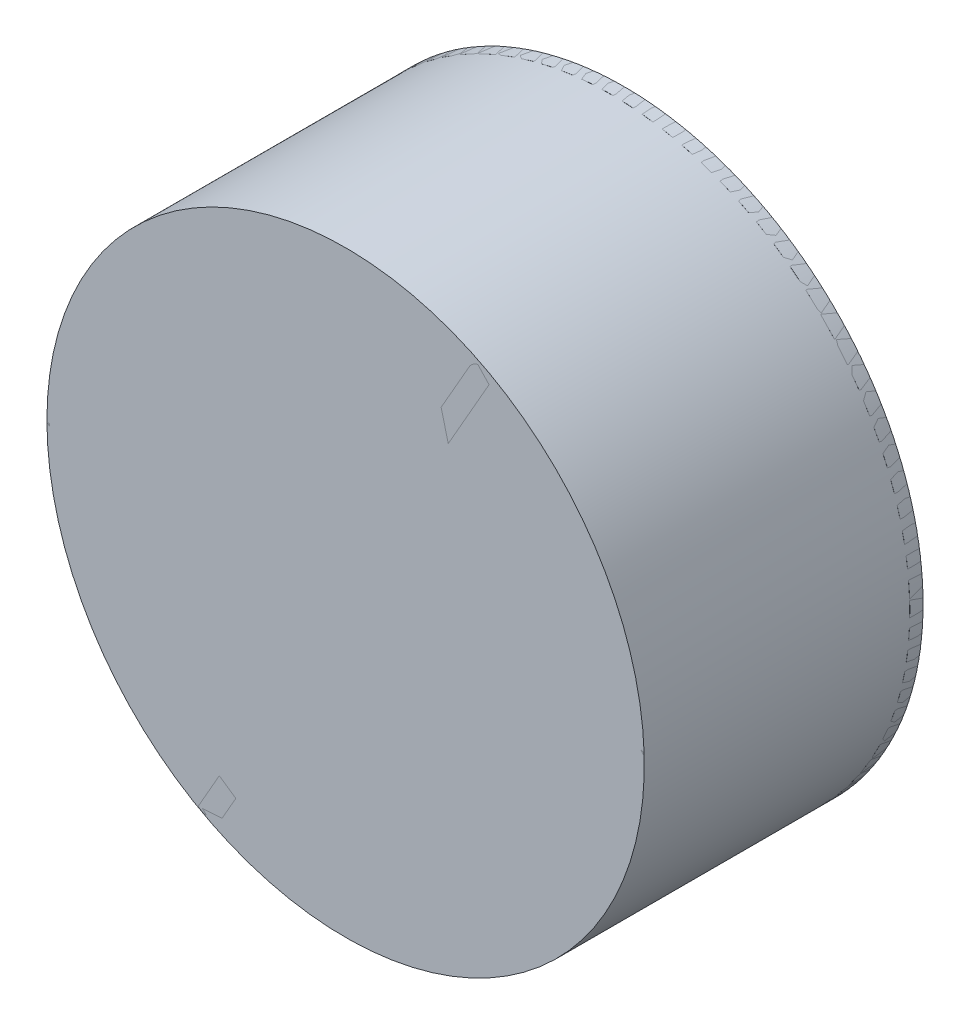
ISO-10303-21;
HEADER;
FILE_DESCRIPTION(('STEP AP214'),'2;1');
FILE_NAME('part.step','',(''),(''),'','','');
FILE_SCHEMA(('AUTOMOTIVE_DESIGN { 1 0 10303 214 1 1 1 1 }'));
ENDSEC;
DATA;
#1=APPLICATION_CONTEXT('core data for automotive mechanical design processes');
#2=APPLICATION_PROTOCOL_DEFINITION('international standard','automotive_design',2000,#1);
#3=PRODUCT_CONTEXT('',#1,'mechanical');
#4=PRODUCT('Part','Part','',(#3));
#5=PRODUCT_RELATED_PRODUCT_CATEGORY('part','',(#4));
#6=PRODUCT_DEFINITION_FORMATION('','',#4);
#7=PRODUCT_DEFINITION_CONTEXT('part definition',#1,'design');
#8=PRODUCT_DEFINITION('design','',#6,#7);
#9=PRODUCT_DEFINITION_SHAPE('','',#8);
#10=(LENGTH_UNIT() NAMED_UNIT(*) SI_UNIT(.MILLI.,.METRE.));
#11=(NAMED_UNIT(*) PLANE_ANGLE_UNIT() SI_UNIT($,.RADIAN.));
#12=(NAMED_UNIT(*) SI_UNIT($,.STERADIAN.) SOLID_ANGLE_UNIT());
#13=UNCERTAINTY_MEASURE_WITH_UNIT(LENGTH_MEASURE(1.E-05),#10,'distance_accuracy_value','');
#14=(GEOMETRIC_REPRESENTATION_CONTEXT(3) GLOBAL_UNCERTAINTY_ASSIGNED_CONTEXT((#13)) GLOBAL_UNIT_ASSIGNED_CONTEXT((#10,
#11,#12)) REPRESENTATION_CONTEXT('',''));
#15=CARTESIAN_POINT('',(0.,0.,0.));
#16=DIRECTION('',(0.,0.,1.));
#17=DIRECTION('',(1.,0.,0.));
#18=AXIS2_PLACEMENT_3D('',#15,#16,#17);
#19=CARTESIAN_POINT('',(0.,0.,20.));
#20=DIRECTION('',(0.,0.,-1.));
#21=DIRECTION('',(-1.,0.,0.));
#22=AXIS2_PLACEMENT_3D('',#19,#20,#21);
#23=CYLINDRICAL_SURFACE('',#22,22.5);
#24=CARTESIAN_POINT('',(0.,0.,20.));
#25=DIRECTION('',(0.,0.,-1.));
#26=DIRECTION('',(-1.,0.,0.));
#27=AXIS2_PLACEMENT_3D('',#24,#25,#26);
#28=CIRCLE('',#27,22.5);
#29=CARTESIAN_POINT('',(-22.5,0.,20.));
#30=VERTEX_POINT('',#29);
#31=EDGE_CURVE('E11',#30,#30,#28,.T.);
#32=CARTESIAN_POINT('',(0.,0.,-1.));
#33=DIRECTION('',(0.,0.,-1.));
#34=DIRECTION('',(-1.,0.,0.));
#35=AXIS2_PLACEMENT_3D('',#32,#33,#34);
#36=CIRCLE('',#35,22.5);
#37=CARTESIAN_POINT('',(-22.5,0.,-1.));
#38=VERTEX_POINT('',#37);
#39=EDGE_CURVE('E57',#38,#38,#36,.T.);
#40=CARTESIAN_POINT('',(-22.5,0.,20.));
#41=CARTESIAN_POINT('',(-22.5,0.,19.78125));
#42=CARTESIAN_POINT('',(-22.5,0.,19.5625));
#43=CARTESIAN_POINT('',(-22.5,0.,19.125));
#44=CARTESIAN_POINT('',(-22.5,0.,18.90625));
#45=CARTESIAN_POINT('',(-22.5,0.,18.46875));
#46=CARTESIAN_POINT('',(-22.5,0.,18.25));
#47=CARTESIAN_POINT('',(-22.5,0.,17.8125));
#48=CARTESIAN_POINT('',(-22.5,0.,17.59375));
#49=CARTESIAN_POINT('',(-22.5,0.,17.15625));
#50=CARTESIAN_POINT('',(-22.5,0.,16.9375));
#51=CARTESIAN_POINT('',(-22.5,0.,16.5));
#52=CARTESIAN_POINT('',(-22.5,0.,16.28125));
#53=CARTESIAN_POINT('',(-22.5,0.,15.84375));
#54=CARTESIAN_POINT('',(-22.5,0.,15.625));
#55=CARTESIAN_POINT('',(-22.5,0.,15.1875));
#56=CARTESIAN_POINT('',(-22.5,0.,14.96875));
#57=CARTESIAN_POINT('',(-22.5,0.,14.53125));
#58=CARTESIAN_POINT('',(-22.5,0.,14.3125));
#59=CARTESIAN_POINT('',(-22.5,0.,13.875));
#60=CARTESIAN_POINT('',(-22.5,0.,13.65625));
#61=CARTESIAN_POINT('',(-22.5,0.,13.21875));
#62=CARTESIAN_POINT('',(-22.5,0.,13.));
#63=CARTESIAN_POINT('',(-22.5,0.,12.5625));
#64=CARTESIAN_POINT('',(-22.5,0.,12.34375));
#65=CARTESIAN_POINT('',(-22.5,0.,11.90625));
#66=CARTESIAN_POINT('',(-22.5,0.,11.6875));
#67=CARTESIAN_POINT('',(-22.5,0.,11.25));
#68=CARTESIAN_POINT('',(-22.5,0.,11.03125));
#69=CARTESIAN_POINT('',(-22.5,0.,10.59375));
#70=CARTESIAN_POINT('',(-22.5,0.,10.375));
#71=CARTESIAN_POINT('',(-22.5,0.,9.9375));
#72=CARTESIAN_POINT('',(-22.5,0.,9.71875));
#73=CARTESIAN_POINT('',(-22.5,0.,9.28125));
#74=CARTESIAN_POINT('',(-22.5,0.,9.0625));
#75=CARTESIAN_POINT('',(-22.5,0.,8.625));
#76=CARTESIAN_POINT('',(-22.5,0.,8.40625));
#77=CARTESIAN_POINT('',(-22.5,0.,7.96875));
#78=CARTESIAN_POINT('',(-22.5,0.,7.75));
#79=CARTESIAN_POINT('',(-22.5,0.,7.3125));
#80=CARTESIAN_POINT('',(-22.5,0.,7.09375));
#81=CARTESIAN_POINT('',(-22.5,0.,6.65625));
#82=CARTESIAN_POINT('',(-22.5,0.,6.4375));
#83=CARTESIAN_POINT('',(-22.5,0.,6.));
#84=CARTESIAN_POINT('',(-22.5,0.,5.78125));
#85=CARTESIAN_POINT('',(-22.5,0.,5.34375));
#86=CARTESIAN_POINT('',(-22.5,0.,5.125));
#87=CARTESIAN_POINT('',(-22.5,0.,4.6875));
#88=CARTESIAN_POINT('',(-22.5,0.,4.46875));
#89=CARTESIAN_POINT('',(-22.5,0.,4.03125));
#90=CARTESIAN_POINT('',(-22.5,0.,3.8125));
#91=CARTESIAN_POINT('',(-22.5,0.,3.375));
#92=CARTESIAN_POINT('',(-22.5,0.,3.15625));
#93=CARTESIAN_POINT('',(-22.5,0.,2.71875));
#94=CARTESIAN_POINT('',(-22.5,0.,2.5));
#95=CARTESIAN_POINT('',(-22.5,0.,2.0625));
#96=CARTESIAN_POINT('',(-22.5,0.,1.84375));
#97=CARTESIAN_POINT('',(-22.5,0.,1.40625));
#98=CARTESIAN_POINT('',(-22.5,0.,1.1875));
#99=CARTESIAN_POINT('',(-22.5,0.,0.750000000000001));
#100=CARTESIAN_POINT('',(-22.5,0.,0.53125));
#101=CARTESIAN_POINT('',(-22.5,0.,0.0937500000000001));
#102=CARTESIAN_POINT('',(-22.5,0.,-0.125));
#103=CARTESIAN_POINT('',(-22.5,0.,-0.562500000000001));
#104=CARTESIAN_POINT('',(-22.5,0.,-0.781250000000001));
#105=CARTESIAN_POINT('',(-22.5,0.,-1.));
#106=B_SPLINE_CURVE_WITH_KNOTS('',3,(#40,#41,#42,#43,#44,#45,#46,#47,#48,#49,#50,#51,#52,#53,
#54,#55,#56,#57,#58,#59,#60,#61,#62,#63,#64,#65,#66,#67,#68,#69,#70,#71,#72,#73,#74,#75,#76,#77,
#78,#79,#80,#81,#82,#83,#84,#85,#86,#87,#88,#89,#90,#91,#92,#93,#94,#95,#96,#97,#98,#99,#100,
#101,#102,#103,#104,#105),.UNSPECIFIED.,.F.,.F.,(4,2,2,2,2,2,2,2,2,2,2,2,2,2,2,2,2,2,2,2,2,2,2,
2,2,2,2,2,2,2,2,2,4),(0.,0.656250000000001,1.3125,1.96875,2.625,3.28125,3.9375,4.59375,5.25,
5.90625,6.5625,7.21875,7.875,8.53125,9.1875,9.84375,10.5,11.15625,11.8125,12.46875,13.125,
13.78125,14.4375,15.09375,15.75,16.40625,17.0625,17.71875,18.375,19.03125,19.6875,20.34375,21.),.UNSPECIFIED.);
#107=EDGE_CURVE('BSEAM54',#30,#38,#106,.T.);
#108=ORIENTED_EDGE('',*,*,#31,.T.);
#109=ORIENTED_EDGE('',*,*,#39,.F.);
#110=ORIENTED_EDGE('',*,*,#107,.T.);
#111=ORIENTED_EDGE('',*,*,#107,.F.);
#112=EDGE_LOOP('',(#108,#110,#109,#111));
#113=FACE_BOUND('',#112,.T.);
#114=ADVANCED_FACE('F54',(#113),#23,.T.);
#115=CARTESIAN_POINT('',(0.,0.,20.));
#116=DIRECTION('',(0.,0.,-1.));
#117=DIRECTION('',(-1.,0.,0.));
#118=AXIS2_PLACEMENT_3D('',#115,#116,#117);
#119=PLANE('',#118);
#120=ORIENTED_EDGE('',*,*,#31,.F.);
#121=EDGE_LOOP('',(#120));
#122=FACE_BOUND('',#121,.T.);
#123=ADVANCED_FACE('F69',(#122),#119,.F.);
#124=CARTESIAN_POINT('',(0.,0.,-1.));
#125=DIRECTION('',(0.,0.,-1.));
#126=DIRECTION('',(-1.,0.,0.));
#127=AXIS2_PLACEMENT_3D('',#124,#125,#126);
#128=PLANE('',#127);
#129=ORIENTED_EDGE('',*,*,#39,.T.);
#130=EDGE_LOOP('',(#129));
#131=FACE_BOUND('',#130,.T.);
#132=ADVANCED_FACE('F66',(#131),#128,.T.);
#133=CLOSED_SHELL('',(#114,#123,#132));
#134=MANIFOLD_SOLID_BREP('B2_NOT_SHOWN',#133);
#135=CARTESIAN_POINT('',(0.,0.,17.5));
#136=DIRECTION('',(0.,0.,-1.));
#137=DIRECTION('',(-1.,0.,0.));
#138=AXIS2_PLACEMENT_3D('',#135,#136,#137);
#139=CYLINDRICAL_SURFACE('',#138,17.5);
#140=CARTESIAN_POINT('',(0.,0.,17.5));
#141=DIRECTION('',(0.,0.,1.));
#142=DIRECTION('',(1.,0.,0.));
#143=AXIS2_PLACEMENT_3D('',#140,#141,#142);
#144=CIRCLE('',#143,17.5);
#145=CARTESIAN_POINT('',(17.5,0.,17.5));
#146=VERTEX_POINT('',#145);
#147=EDGE_CURVE('E53',#146,#146,#144,.T.);
#148=ORIENTED_EDGE('',*,*,#147,.F.);
#149=EDGE_LOOP('',(#148));
#150=FACE_BOUND('',#149,.T.);
#151=CARTESIAN_POINT('',(0.,0.,-1.5));
#152=DIRECTION('',(0.,0.,1.));
#153=DIRECTION('',(1.,0.,0.));
#154=AXIS2_PLACEMENT_3D('',#151,#152,#153);
#155=CIRCLE('',#154,17.5);
#156=CARTESIAN_POINT('',(17.5,0.,-1.5));
#157=VERTEX_POINT('',#156);
#158=EDGE_CURVE('E130',#157,#157,#155,.T.);
#159=ORIENTED_EDGE('',*,*,#158,.T.);
#160=EDGE_LOOP('',(#159));
#161=FACE_BOUND('',#160,.T.);
#162=ADVANCED_FACE('F127',(#150,#161),#139,.T.);
#163=CARTESIAN_POINT('',(0.,0.,17.5));
#164=DIRECTION('',(0.,0.,1.));
#165=DIRECTION('',(1.,0.,0.));
#166=AXIS2_PLACEMENT_3D('',#163,#164,#165);
#167=PLANE('',#166);
#168=ORIENTED_EDGE('',*,*,#147,.T.);
#169=EDGE_LOOP('',(#168));
#170=FACE_BOUND('',#169,.T.);
#171=ADVANCED_FACE('F142',(#170),#167,.T.);
#172=CARTESIAN_POINT('',(0.,0.,-1.5));
#173=DIRECTION('',(0.,0.,1.));
#174=DIRECTION('',(1.,0.,0.));
#175=AXIS2_PLACEMENT_3D('',#172,#173,#174);
#176=PLANE('',#175);
#177=ORIENTED_EDGE('',*,*,#158,.F.);
#178=EDGE_LOOP('',(#177));
#179=FACE_BOUND('',#178,.T.);
#180=ADVANCED_FACE('F140',(#179),#176,.F.);
#181=CLOSED_SHELL('',(#162,#171,#180));
#182=MANIFOLD_SOLID_BREP('B6',#181);
#183=CARTESIAN_POINT('',(0.,0.,0.));
#184=DIRECTION('',(0.,0.,1.));
#185=DIRECTION('',(1.,0.,0.));
#186=AXIS2_PLACEMENT_3D('',#183,#184,#185);
#187=PLANE('',#186);
#188=CARTESIAN_POINT('',(0.,0.,0.));
#189=DIRECTION('',(0.,0.,1.));
#190=DIRECTION('',(1.,0.,0.));
#191=AXIS2_PLACEMENT_3D('',#188,#189,#190);
#192=CIRCLE('',#191,3.);
#193=CARTESIAN_POINT('',(3.,0.,0.));
#194=VERTEX_POINT('',#193);
#195=EDGE_CURVE('E125',#194,#194,#192,.F.);
#196=ORIENTED_EDGE('',*,*,#195,.T.);
#197=EDGE_LOOP('',(#196));
#198=FACE_BOUND('',#197,.T.);
#199=CARTESIAN_POINT('',(0.,0.,0.));
#200=DIRECTION('',(0.,0.,1.));
#201=DIRECTION('',(1.,0.,0.));
#202=AXIS2_PLACEMENT_3D('',#199,#200,#201);
#203=CIRCLE('',#202,22.5);
#204=CARTESIAN_POINT('',(-9.80991950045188,-20.2488389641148,0.));
#205=VERTEX_POINT('',#204);
#206=CARTESIAN_POINT('',(12.6310491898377,-18.6200589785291,0.));
#207=VERTEX_POINT('',#206);
#208=EDGE_CURVE('E972',#205,#207,#203,.T.);
#209=ORIENTED_EDGE('',*,*,#208,.T.);
#210=CARTESIAN_POINT('',(22.4409686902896,1.62877998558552,0.));
#211=VERTEX_POINT('',#210);
#212=EDGE_CURVE('E774',#207,#211,#203,.T.);
#213=ORIENTED_EDGE('',*,*,#212,.T.);
#214=CARTESIAN_POINT('',(9.80991950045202,20.2488389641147,0.));
#215=VERTEX_POINT('',#214);
#216=EDGE_CURVE('E780',#211,#215,#203,.T.);
#217=ORIENTED_EDGE('',*,*,#216,.T.);
#218=CARTESIAN_POINT('',(-12.6310491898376,18.6200589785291,0.));
#219=VERTEX_POINT('',#218);
#220=EDGE_CURVE('E784',#215,#219,#203,.T.);
#221=ORIENTED_EDGE('',*,*,#220,.T.);
#222=CARTESIAN_POINT('',(-22.4409686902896,-1.62877998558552,0.));
#223=VERTEX_POINT('',#222);
#224=EDGE_CURVE('E966',#219,#223,#203,.T.);
#225=ORIENTED_EDGE('',*,*,#224,.T.);
#226=EDGE_CURVE('E969',#223,#205,#203,.T.);
#227=ORIENTED_EDGE('',*,*,#226,.T.);
#228=EDGE_LOOP('',(#209,#213,#217,#221,#225,#227));
#229=FACE_BOUND('',#228,.T.);
#230=CARTESIAN_POINT('',(11.2646157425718,-18.2542691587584,0.));
#231=DIRECTION('',(0.,0.,1.));
#232=DIRECTION('',(1.,0.,0.));
#233=AXIS2_PLACEMENT_3D('',#230,#231,#232);
#234=CIRCLE('',#233,1.);
#235=CARTESIAN_POINT('',(12.1301588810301,-17.7534347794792,0.));
#236=VERTEX_POINT('',#235);
#237=CARTESIAN_POINT('',(11.7646157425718,-19.1202945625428,0.));
#238=VERTEX_POINT('',#237);
#239=EDGE_CURVE('E953',#236,#238,#234,.F.);
#240=ORIENTED_EDGE('',*,*,#239,.T.);
#241=DIRECTION('',(0.86602540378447,0.499999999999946,0.));
#242=VECTOR('',#241,1.);
#243=CARTESIAN_POINT('',(11.332011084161,-19.370058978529,0.));
#244=LINE('',#243,#242);
#245=CARTESIAN_POINT('',(11.332011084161,-19.370058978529,0.));
#246=VERTEX_POINT('',#245);
#247=EDGE_CURVE('E209',#246,#238,#244,.T.);
#248=ORIENTED_EDGE('',*,*,#247,.F.);
#249=CARTESIAN_POINT('',(4.56730954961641,-7.91081219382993,0.));
#250=CARTESIAN_POINT('',(6.8070560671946,-11.7901669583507,0.));
#251=CARTESIAN_POINT('',(6.43456020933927,-10.8874252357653,0.));
#252=CARTESIAN_POINT('',(11.3320110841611,-19.3700589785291,0.));
#253=B_SPLINE_CURVE_WITH_KNOTS('',3,(#249,#250,#251,#252),.UNSPECIFIED.,.F.,.F.,(4,4),(0.,
0.864171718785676),.UNSPECIFIED.);
#254=CARTESIAN_POINT('',(4.56730954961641,-7.91081219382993,0.));
#255=VERTEX_POINT('',#254);
#256=EDGE_CURVE('E465',#255,#246,#253,.T.);
#257=ORIENTED_EDGE('',*,*,#256,.F.);
#258=DIRECTION('',(-0.866025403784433,-0.50000000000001,0.));
#259=VECTOR('',#258,1.);
#260=CARTESIAN_POINT('',(5.86634765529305,-7.16081219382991,0.));
#261=LINE('',#260,#259);
#262=CARTESIAN_POINT('',(5.00243766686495,-7.6595908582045,0.));
#263=VERTEX_POINT('',#262);
#264=EDGE_CURVE('E461',#263,#255,#261,.T.);
#265=ORIENTED_EDGE('',*,*,#264,.F.);
#266=CARTESIAN_POINT('',(5.50243766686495,-8.52561626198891,0.));
#267=DIRECTION('',(0.,0.,1.));
#268=DIRECTION('',(1.,0.,0.));
#269=AXIS2_PLACEMENT_3D('',#266,#267,#268);
#270=CIRCLE('',#269,1.);
#271=CARTESIAN_POINT('',(6.3658415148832,-8.02110283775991,0.));
#272=VERTEX_POINT('',#271);
#273=EDGE_CURVE('E884',#263,#272,#270,.F.);
#274=ORIENTED_EDGE('',*,*,#273,.T.);
#275=CARTESIAN_POINT('',(12.6310491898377,-18.6200589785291,0.));
#276=CARTESIAN_POINT('',(12.4829634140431,-18.3635668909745,0.));
#277=CARTESIAN_POINT('',(12.1792383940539,-17.8380034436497,0.));
#278=CARTESIAN_POINT('',(11.6296531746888,-16.888991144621,0.));
#279=CARTESIAN_POINT('',(11.0061047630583,-15.8159040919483,0.));
#280=CARTESIAN_POINT('',(10.3607650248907,-14.7110050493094,0.));
#281=CARTESIAN_POINT('',(9.61751289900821,-13.4458683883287,0.));
#282=CARTESIAN_POINT('',(8.88142731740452,-12.2063270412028,0.));
#283=CARTESIAN_POINT('',(8.21489008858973,-11.1005128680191,0.));
#284=CARTESIAN_POINT('',(7.67575415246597,-10.2151697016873,0.));
#285=CARTESIAN_POINT('',(7.17663439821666,-9.39252080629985,0.));
#286=CARTESIAN_POINT('',(6.70875367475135,-8.6069393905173,0.));
#287=CARTESIAN_POINT('',(6.26757372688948,-7.85375731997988,0.));
#288=CARTESIAN_POINT('',(5.99537497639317,-7.38429406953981,0.));
#289=CARTESIAN_POINT('',(5.86634765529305,-7.16081219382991,0.));
#290=B_SPLINE_CURVE_WITH_KNOTS('',3,(#275,#276,#277,#278,#279,#280,#281,#282,#283,#284,#285,
#286,#287,#288,#289),.UNSPECIFIED.,.F.,.F.,(4,1,1,1,1,1,1,1,1,1,1,1,4),(0.,0.0270053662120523,
0.0540107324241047,0.10802146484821,0.162032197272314,0.216042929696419,0.324064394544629,
0.432085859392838,0.540107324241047,0.648128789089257,0.756150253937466,0.810160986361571,
0.864171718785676),.UNSPECIFIED.);
#291=EDGE_CURVE('E1557',#236,#272,#290,.T.);
#292=ORIENTED_EDGE('',*,*,#291,.F.);
#293=EDGE_LOOP('',(#240,#248,#257,#265,#274,#292));
#294=FACE_BOUND('',#293,.T.);
#295=CARTESIAN_POINT('',(-10.1763529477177,-18.8825779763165,0.));
#296=DIRECTION('',(0.,0.,1.));
#297=DIRECTION('',(1.,0.,0.));
#298=AXIS2_PLACEMENT_3D('',#295,#296,#297);
#299=CIRCLE('',#298,1.);
#300=CARTESIAN_POINT('',(-9.30984608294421,-19.381743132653,0.));
#301=VERTEX_POINT('',#300);
#302=CARTESIAN_POINT('',(-10.6763529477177,-19.7486033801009,0.));
#303=VERTEX_POINT('',#302);
#304=EDGE_CURVE('E940',#301,#303,#299,.F.);
#305=ORIENTED_EDGE('',*,*,#304,.T.);
#306=DIRECTION('',(0.866025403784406,-0.500000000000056,0.));
#307=VECTOR('',#306,1.);
#308=CARTESIAN_POINT('',(-11.1089576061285,-19.4988389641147,0.));
#309=LINE('',#308,#307);
#310=CARTESIAN_POINT('',(-11.1089576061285,-19.4988389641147,0.));
#311=VERTEX_POINT('',#310);
#312=EDGE_CURVE('E473',#311,#303,#309,.T.);
#313=ORIENTED_EDGE('',*,*,#312,.F.);
#314=CARTESIAN_POINT('',(-4.56730954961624,-7.91081219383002,0.));
#315=CARTESIAN_POINT('',(-6.80705606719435,-11.7901669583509,0.));
#316=CARTESIAN_POINT('',(-6.21150673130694,-11.016205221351,0.));
#317=CARTESIAN_POINT('',(-11.1089576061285,-19.4988389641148,0.));
#318=B_SPLINE_CURVE_WITH_KNOTS('',3,(#314,#315,#316,#317),.UNSPECIFIED.,.F.,.F.,(4,4),(0.,
0.864171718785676),.UNSPECIFIED.);
#319=CARTESIAN_POINT('',(-4.56730954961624,-7.91081219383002,0.));
#320=VERTEX_POINT('',#319);
#321=EDGE_CURVE('E467',#320,#311,#318,.T.);
#322=ORIENTED_EDGE('',*,*,#321,.F.);
#323=DIRECTION('',(-0.866025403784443,0.499999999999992,0.));
#324=VECTOR('',#323,1.);
#325=CARTESIAN_POINT('',(-3.26827144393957,-8.66081219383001,0.));
#326=LINE('',#325,#324);
#327=CARTESIAN_POINT('',(-4.13218143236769,-8.16203352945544,0.));
#328=VERTEX_POINT('',#327);
#329=EDGE_CURVE('E486',#328,#320,#326,.T.);
#330=ORIENTED_EDGE('',*,*,#329,.F.);
#331=CARTESIAN_POINT('',(-4.63218143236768,-9.02805893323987,0.));
#332=DIRECTION('',(0.,0.,1.));
#333=DIRECTION('',(1.,0.,0.));
#334=AXIS2_PLACEMENT_3D('',#331,#332,#333);
#335=CIRCLE('',#334,1.);
#336=CARTESIAN_POINT('',(-3.76355806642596,-9.52353188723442,0.));
#337=VERTEX_POINT('',#336);
#338=EDGE_CURVE('E869',#328,#337,#335,.F.);
#339=ORIENTED_EDGE('',*,*,#338,.T.);
#340=CARTESIAN_POINT('',(-9.80991950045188,-20.2488389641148,0.));
#341=CARTESIAN_POINT('',(-9.66183372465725,-19.9923468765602,0.));
#342=CARTESIAN_POINT('',(-9.35854493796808,-19.4665315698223,0.));
#343=CARTESIAN_POINT('',(-8.81146878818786,-18.5160706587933,0.));
#344=CARTESIAN_POINT('',(-8.19392234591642,-17.4395183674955,0.));
#345=CARTESIAN_POINT('',(-7.55972157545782,-16.3281882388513,0.));
#346=CARTESIAN_POINT('',(-6.83570715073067,-15.0519446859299,0.));
#347=CARTESIAN_POINT('',(-6.13027564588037,-13.7947051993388,0.));
#348=CARTESIAN_POINT('',(-5.50588109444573,-12.6645599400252,0.));
#349=CARTESIAN_POINT('',(-5.00871938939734,-11.7549829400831,0.));
#350=CARTESIAN_POINT('',(-4.54584442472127,-10.9114081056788,0.));
#351=CARTESIAN_POINT('',(-4.09945132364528,-10.1134208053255,0.));
#352=CARTESIAN_POINT('',(-3.66776649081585,-9.35475672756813,0.));
#353=CARTESIAN_POINT('',(-3.39729876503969,-8.88429406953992,0.));
#354=CARTESIAN_POINT('',(-3.26827144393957,-8.66081219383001,0.));
#355=B_SPLINE_CURVE_WITH_KNOTS('',3,(#340,#341,#342,#343,#344,#345,#346,#347,#348,#349,#350,
#351,#352,#353,#354),.UNSPECIFIED.,.F.,.F.,(4,1,1,1,1,1,1,1,1,1,1,1,4),(0.,0.0270053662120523,
0.0540107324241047,0.10802146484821,0.162032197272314,0.216042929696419,0.324064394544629,
0.432085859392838,0.540107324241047,0.648128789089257,0.756150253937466,0.810160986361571,
0.864171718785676),.UNSPECIFIED.);
#356=EDGE_CURVE('E1597',#301,#337,#355,.T.);
#357=ORIENTED_EDGE('',*,*,#356,.F.);
#358=EDGE_LOOP('',(#305,#313,#322,#330,#339,#357));
#359=FACE_BOUND('',#358,.T.);
#360=CARTESIAN_POINT('',(-21.4409686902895,-0.628308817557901,0.));
#361=DIRECTION('',(0.,0.,1.));
#362=DIRECTION('',(1.,0.,0.));
#363=AXIS2_PLACEMENT_3D('',#360,#361,#362);
#364=CIRCLE('',#363,1.);
#365=CARTESIAN_POINT('',(-21.4400049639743,-1.62830835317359,0.));
#366=VERTEX_POINT('',#365);
#367=CARTESIAN_POINT('',(-22.4409686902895,-0.628308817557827,0.));
#368=VERTEX_POINT('',#367);
#369=EDGE_CURVE('E926',#366,#368,#364,.F.);
#370=ORIENTED_EDGE('',*,*,#369,.T.);
#371=DIRECTION('',(0.,-1.,0.));
#372=VECTOR('',#371,1.);
#373=CARTESIAN_POINT('',(-22.4409686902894,-0.128779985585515,0.));
#374=LINE('',#373,#372);
#375=CARTESIAN_POINT('',(-22.4409686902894,-0.128779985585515,0.));
#376=VERTEX_POINT('',#375);
#377=EDGE_CURVE('E536',#376,#368,#374,.T.);
#378=ORIENTED_EDGE('',*,*,#377,.F.);
#379=CARTESIAN_POINT('',(-9.13461909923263,0.,0.));
#380=CARTESIAN_POINT('',(-13.6141121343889,0.,0.));
#381=CARTESIAN_POINT('',(-12.6460669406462,-0.128779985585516,0.));
#382=CARTESIAN_POINT('',(-22.4409686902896,-0.128779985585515,0.));
#383=B_SPLINE_CURVE_WITH_KNOTS('',3,(#379,#380,#381,#382),.UNSPECIFIED.,.F.,.F.,(4,4),(0.,
0.864171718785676),.UNSPECIFIED.);
#384=CARTESIAN_POINT('',(-9.13461909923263,0.,0.));
#385=VERTEX_POINT('',#384);
#386=EDGE_CURVE('E530',#385,#376,#383,.T.);
#387=ORIENTED_EDGE('',*,*,#386,.F.);
#388=DIRECTION('',(0.,1.,0.));
#389=VECTOR('',#388,1.);
#390=CARTESIAN_POINT('',(-9.13461909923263,-1.5,0.));
#391=LINE('',#390,#389);
#392=CARTESIAN_POINT('',(-9.13461909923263,-0.502442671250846,0.));
#393=VERTEX_POINT('',#392);
#394=EDGE_CURVE('E548',#393,#385,#391,.T.);
#395=ORIENTED_EDGE('',*,*,#394,.F.);
#396=CARTESIAN_POINT('',(-10.1346190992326,-0.502442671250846,0.));
#397=DIRECTION('',(0.,0.,1.));
#398=DIRECTION('',(1.,0.,0.));
#399=AXIS2_PLACEMENT_3D('',#396,#397,#398);
#400=CIRCLE('',#399,1.);
#401=CARTESIAN_POINT('',(-10.1293995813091,-1.50242904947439,0.));
#402=VERTEX_POINT('',#401);
#403=EDGE_CURVE('E854',#393,#402,#400,.F.);
#404=ORIENTED_EDGE('',*,*,#403,.T.);
#405=CARTESIAN_POINT('',(-22.4409686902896,-1.62877998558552,0.));
#406=CARTESIAN_POINT('',(-22.1447971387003,-1.62877998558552,0.));
#407=CARTESIAN_POINT('',(-21.5377833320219,-1.62852812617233,0.));
#408=CARTESIAN_POINT('',(-20.4411219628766,-1.62707951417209,0.));
#409=CARTESIAN_POINT('',(-19.2000271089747,-1.62361427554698,0.));
#410=CARTESIAN_POINT('',(-17.9204866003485,-1.6171831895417,0.));
#411=CARTESIAN_POINT('',(-16.4532200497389,-1.60607629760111,0.));
#412=CARTESIAN_POINT('',(-15.0117029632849,-1.5883781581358,0.));
#413=CARTESIAN_POINT('',(-13.7207711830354,-1.56404707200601,0.));
#414=CARTESIAN_POINT('',(-12.6844735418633,-1.53981323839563,0.));
#415=CARTESIAN_POINT('',(-11.7224788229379,-1.51888729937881,0.));
#416=CARTESIAN_POINT('',(-10.8082049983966,-1.5064814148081,0.));
#417=CARTESIAN_POINT('',(-9.93534021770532,-1.50099940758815,0.));
#418=CARTESIAN_POINT('',(-9.39267374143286,-1.5,0.));
#419=CARTESIAN_POINT('',(-9.13461909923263,-1.5,0.));
#420=B_SPLINE_CURVE_WITH_KNOTS('',3,(#405,#406,#407,#408,#409,#410,#411,#412,#413,#414,#415,
#416,#417,#418,#419),.UNSPECIFIED.,.F.,.F.,(4,1,1,1,1,1,1,1,1,1,1,1,4),(0.,0.0270053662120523,
0.0540107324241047,0.10802146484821,0.162032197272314,0.216042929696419,0.324064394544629,
0.432085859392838,0.540107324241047,0.648128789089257,0.756150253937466,0.810160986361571,
0.864171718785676),.UNSPECIFIED.);
#421=EDGE_CURVE('E543',#366,#402,#420,.T.);
#422=ORIENTED_EDGE('',*,*,#421,.F.);
#423=EDGE_LOOP('',(#370,#378,#387,#395,#404,#422));
#424=FACE_BOUND('',#423,.T.);
#425=CARTESIAN_POINT('',(-11.2646157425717,18.2542691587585,0.));
#426=DIRECTION('',(0.,0.,1.));
#427=DIRECTION('',(1.,0.,0.));
#428=AXIS2_PLACEMENT_3D('',#425,#426,#427);
#429=CIRCLE('',#428,1.);
#430=CARTESIAN_POINT('',(-12.13015888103,17.7534347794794,0.));
#431=VERTEX_POINT('',#430);
#432=CARTESIAN_POINT('',(-11.7646157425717,19.1202945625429,0.));
#433=VERTEX_POINT('',#432);
#434=EDGE_CURVE('E912',#431,#433,#429,.F.);
#435=ORIENTED_EDGE('',*,*,#434,.T.);
#436=DIRECTION('',(-0.866025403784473,-0.49999999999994,0.));
#437=VECTOR('',#436,1.);
#438=CARTESIAN_POINT('',(-11.3320110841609,19.3700589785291,0.));
#439=LINE('',#438,#437);
#440=CARTESIAN_POINT('',(-11.3320110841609,19.3700589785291,0.));
#441=VERTEX_POINT('',#440);
#442=EDGE_CURVE('E1637',#441,#433,#439,.T.);
#443=ORIENTED_EDGE('',*,*,#442,.F.);
#444=CARTESIAN_POINT('',(-4.56730954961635,7.91081219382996,0.));
#445=CARTESIAN_POINT('',(-6.80705606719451,11.7901669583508,0.));
#446=CARTESIAN_POINT('',(-6.4345602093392,10.8874252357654,0.));
#447=CARTESIAN_POINT('',(-11.3320110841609,19.3700589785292,0.));
#448=B_SPLINE_CURVE_WITH_KNOTS('',3,(#444,#445,#446,#447),.UNSPECIFIED.,.F.,.F.,(4,4),(0.,
0.864171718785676),.UNSPECIFIED.);
#449=CARTESIAN_POINT('',(-4.56730954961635,7.91081219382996,0.));
#450=VERTEX_POINT('',#449);
#451=EDGE_CURVE('E561',#450,#441,#448,.T.);
#452=ORIENTED_EDGE('',*,*,#451,.F.);
#453=DIRECTION('',(0.866025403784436,0.500000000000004,0.));
#454=VECTOR('',#453,1.);
#455=CARTESIAN_POINT('',(-5.86634765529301,7.16081219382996,0.));
#456=LINE('',#455,#454);
#457=CARTESIAN_POINT('',(-5.0024376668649,7.65959085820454,0.));
#458=VERTEX_POINT('',#457);
#459=EDGE_CURVE('E570',#458,#450,#456,.T.);
#460=ORIENTED_EDGE('',*,*,#459,.F.);
#461=CARTESIAN_POINT('',(-5.50243766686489,8.52561626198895,0.));
#462=DIRECTION('',(0.,0.,1.));
#463=DIRECTION('',(1.,0.,0.));
#464=AXIS2_PLACEMENT_3D('',#461,#462,#463);
#465=CIRCLE('',#464,1.);
#466=CARTESIAN_POINT('',(-6.36584151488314,8.02110283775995,0.));
#467=VERTEX_POINT('',#466);
#468=EDGE_CURVE('E839',#458,#467,#465,.F.);
#469=ORIENTED_EDGE('',*,*,#468,.T.);
#470=CARTESIAN_POINT('',(-12.6310491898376,18.6200589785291,0.));
#471=CARTESIAN_POINT('',(-12.4829634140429,18.3635668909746,0.));
#472=CARTESIAN_POINT('',(-12.1792383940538,17.8380034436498,0.));
#473=CARTESIAN_POINT('',(-11.6296531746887,16.8889911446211,0.));
#474=CARTESIAN_POINT('',(-11.0061047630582,15.8159040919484,0.));
#475=CARTESIAN_POINT('',(-10.3607650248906,14.7110050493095,0.));
#476=CARTESIAN_POINT('',(-9.61751289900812,13.4458683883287,0.));
#477=CARTESIAN_POINT('',(-8.88142731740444,12.2063270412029,0.));
#478=CARTESIAN_POINT('',(-8.21489008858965,11.1005128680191,0.));
#479=CARTESIAN_POINT('',(-7.6757541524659,10.2151697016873,0.));
#480=CARTESIAN_POINT('',(-7.17663439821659,9.3925208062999,0.));
#481=CARTESIAN_POINT('',(-6.70875367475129,8.60693939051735,0.));
#482=CARTESIAN_POINT('',(-6.26757372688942,7.85375731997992,0.));
#483=CARTESIAN_POINT('',(-5.99537497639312,7.38429406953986,0.));
#484=CARTESIAN_POINT('',(-5.86634765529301,7.16081219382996,0.));
#485=B_SPLINE_CURVE_WITH_KNOTS('',3,(#470,#471,#472,#473,#474,#475,#476,#477,#478,#479,#480,
#481,#482,#483,#484),.UNSPECIFIED.,.F.,.F.,(4,1,1,1,1,1,1,1,1,1,1,1,4),(0.,0.0270053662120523,
0.0540107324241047,0.10802146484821,0.162032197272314,0.216042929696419,0.324064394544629,
0.432085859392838,0.540107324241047,0.648128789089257,0.756150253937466,0.810160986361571,
0.864171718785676),.UNSPECIFIED.);
#486=EDGE_CURVE('E1643',#431,#467,#485,.T.);
#487=ORIENTED_EDGE('',*,*,#486,.F.);
#488=EDGE_LOOP('',(#435,#443,#452,#460,#469,#487));
#489=FACE_BOUND('',#488,.T.);
#490=DIRECTION('',(0.,1.,0.));
#491=VECTOR('',#490,1.);
#492=CARTESIAN_POINT('',(22.4409686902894,0.128779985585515,0.));
#493=LINE('',#492,#491);
#494=CARTESIAN_POINT('',(22.4409686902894,0.128779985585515,0.));
#495=VERTEX_POINT('',#494);
#496=CARTESIAN_POINT('',(22.4409686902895,0.628308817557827,0.));
#497=VERTEX_POINT('',#496);
#498=EDGE_CURVE('E996',#495,#497,#493,.T.);
#499=ORIENTED_EDGE('',*,*,#498,.F.);
#500=CARTESIAN_POINT('',(9.13461909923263,0.,0.));
#501=CARTESIAN_POINT('',(13.6141121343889,0.,0.));
#502=CARTESIAN_POINT('',(12.6460669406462,0.128779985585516,0.));
#503=CARTESIAN_POINT('',(22.4409686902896,0.128779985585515,0.));
#504=B_SPLINE_CURVE_WITH_KNOTS('',3,(#500,#501,#502,#503),.UNSPECIFIED.,.F.,.F.,(4,4),(0.,
0.864171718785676),.UNSPECIFIED.);
#505=CARTESIAN_POINT('',(9.13461909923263,0.,0.));
#506=VERTEX_POINT('',#505);
#507=EDGE_CURVE('E645',#506,#495,#504,.T.);
#508=ORIENTED_EDGE('',*,*,#507,.F.);
#509=DIRECTION('',(0.,-1.,0.));
#510=VECTOR('',#509,1.);
#511=CARTESIAN_POINT('',(9.13461909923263,1.5,0.));
#512=LINE('',#511,#510);
#513=CARTESIAN_POINT('',(9.13461909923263,0.502442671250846,0.));
#514=VERTEX_POINT('',#513);
#515=EDGE_CURVE('E654',#514,#506,#512,.T.);
#516=ORIENTED_EDGE('',*,*,#515,.F.);
#517=CARTESIAN_POINT('',(10.1346190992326,0.502442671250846,0.));
#518=DIRECTION('',(0.,0.,1.));
#519=DIRECTION('',(1.,0.,0.));
#520=AXIS2_PLACEMENT_3D('',#517,#518,#519);
#521=CIRCLE('',#520,1.);
#522=CARTESIAN_POINT('',(10.1293995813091,1.50242904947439,0.));
#523=VERTEX_POINT('',#522);
#524=EDGE_CURVE('E795',#514,#523,#521,.F.);
#525=ORIENTED_EDGE('',*,*,#524,.T.);
#526=CARTESIAN_POINT('',(22.4409686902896,1.62877998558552,0.));
#527=CARTESIAN_POINT('',(22.1447971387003,1.62877998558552,0.));
#528=CARTESIAN_POINT('',(21.5377833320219,1.62852812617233,0.));
#529=CARTESIAN_POINT('',(20.4411219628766,1.62707951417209,0.));
#530=CARTESIAN_POINT('',(19.2000271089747,1.62361427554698,0.));
#531=CARTESIAN_POINT('',(17.9204866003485,1.6171831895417,0.));
#532=CARTESIAN_POINT('',(16.4532200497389,1.60607629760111,0.));
#533=CARTESIAN_POINT('',(15.0117029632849,1.5883781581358,0.));
#534=CARTESIAN_POINT('',(13.7207711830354,1.56404707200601,0.));
#535=CARTESIAN_POINT('',(12.6844735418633,1.53981323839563,0.));
#536=CARTESIAN_POINT('',(11.7224788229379,1.51888729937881,0.));
#537=CARTESIAN_POINT('',(10.8082049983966,1.5064814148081,0.));
#538=CARTESIAN_POINT('',(9.93534021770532,1.50099940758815,0.));
#539=CARTESIAN_POINT('',(9.39267374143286,1.5,0.));
#540=CARTESIAN_POINT('',(9.13461909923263,1.5,0.));
#541=B_SPLINE_CURVE_WITH_KNOTS('',3,(#526,#527,#528,#529,#530,#531,#532,#533,#534,#535,#536,
#537,#538,#539,#540),.UNSPECIFIED.,.F.,.F.,(4,1,1,1,1,1,1,1,1,1,1,1,4),(0.,0.0270053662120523,
0.0540107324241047,0.10802146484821,0.162032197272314,0.216042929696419,0.324064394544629,
0.432085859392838,0.540107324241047,0.648128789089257,0.756150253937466,0.810160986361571,
0.864171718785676),.UNSPECIFIED.);
#542=CARTESIAN_POINT('',(21.4400049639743,1.62830835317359,0.));
#543=VERTEX_POINT('',#542);
#544=EDGE_CURVE('E1054',#543,#523,#541,.T.);
#545=ORIENTED_EDGE('',*,*,#544,.F.);
#546=CARTESIAN_POINT('',(21.4409686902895,0.628308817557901,0.));
#547=DIRECTION('',(0.,0.,1.));
#548=DIRECTION('',(1.,0.,0.));
#549=AXIS2_PLACEMENT_3D('',#546,#547,#548);
#550=CIRCLE('',#549,1.);
#551=EDGE_CURVE('E809',#543,#497,#550,.F.);
#552=ORIENTED_EDGE('',*,*,#551,.T.);
#553=EDGE_LOOP('',(#499,#508,#516,#525,#545,#552));
#554=FACE_BOUND('',#553,.T.);
#555=CARTESIAN_POINT('',(10.1763529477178,18.8825779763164,0.));
#556=DIRECTION('',(0.,0.,1.));
#557=DIRECTION('',(1.,0.,0.));
#558=AXIS2_PLACEMENT_3D('',#555,#556,#557);
#559=CIRCLE('',#558,1.);
#560=CARTESIAN_POINT('',(9.30984608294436,19.381743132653,0.));
#561=VERTEX_POINT('',#560);
#562=CARTESIAN_POINT('',(10.6763529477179,19.7486033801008,0.));
#563=VERTEX_POINT('',#562);
#564=EDGE_CURVE('E898',#561,#563,#559,.F.);
#565=ORIENTED_EDGE('',*,*,#564,.T.);
#566=DIRECTION('',(-0.866025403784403,0.500000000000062,0.));
#567=VECTOR('',#566,1.);
#568=CARTESIAN_POINT('',(11.1089576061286,19.4988389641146,0.));
#569=LINE('',#568,#567);
#570=CARTESIAN_POINT('',(11.1089576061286,19.4988389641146,0.));
#571=VERTEX_POINT('',#570);
#572=EDGE_CURVE('E620',#571,#563,#569,.T.);
#573=ORIENTED_EDGE('',*,*,#572,.F.);
#574=CARTESIAN_POINT('',(4.5673095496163,7.91081219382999,0.));
#575=CARTESIAN_POINT('',(6.80705606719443,11.7901669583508,0.));
#576=CARTESIAN_POINT('',(6.21150673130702,11.0162052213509,0.));
#577=CARTESIAN_POINT('',(11.1089576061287,19.4988389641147,0.));
#578=B_SPLINE_CURVE_WITH_KNOTS('',3,(#574,#575,#576,#577),.UNSPECIFIED.,.F.,.F.,(4,4),(0.,
0.864171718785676),.UNSPECIFIED.);
#579=CARTESIAN_POINT('',(4.5673095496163,7.91081219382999,0.));
#580=VERTEX_POINT('',#579);
#581=EDGE_CURVE('E614',#580,#571,#578,.T.);
#582=ORIENTED_EDGE('',*,*,#581,.F.);
#583=DIRECTION('',(0.86602540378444,-0.499999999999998,0.));
#584=VECTOR('',#583,1.);
#585=CARTESIAN_POINT('',(3.26827144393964,8.66081219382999,0.));
#586=LINE('',#585,#584);
#587=CARTESIAN_POINT('',(4.13218143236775,8.16203352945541,0.));
#588=VERTEX_POINT('',#587);
#589=EDGE_CURVE('E632',#588,#580,#586,.T.);
#590=ORIENTED_EDGE('',*,*,#589,.F.);
#591=CARTESIAN_POINT('',(4.63218143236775,9.02805893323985,0.));
#592=DIRECTION('',(0.,0.,1.));
#593=DIRECTION('',(1.,0.,0.));
#594=AXIS2_PLACEMENT_3D('',#591,#592,#593);
#595=CIRCLE('',#594,1.);
#596=CARTESIAN_POINT('',(3.76355806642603,9.5235318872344,0.));
#597=VERTEX_POINT('',#596);
#598=EDGE_CURVE('E824',#588,#597,#595,.F.);
#599=ORIENTED_EDGE('',*,*,#598,.T.);
#600=CARTESIAN_POINT('',(9.80991950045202,20.2488389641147,0.));
#601=CARTESIAN_POINT('',(9.66183372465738,19.9923468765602,0.));
#602=CARTESIAN_POINT('',(9.35854493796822,19.4665315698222,0.));
#603=CARTESIAN_POINT('',(8.81146878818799,18.5160706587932,0.));
#604=CARTESIAN_POINT('',(8.19392234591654,17.4395183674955,0.));
#605=CARTESIAN_POINT('',(7.55972157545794,16.3281882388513,0.));
#606=CARTESIAN_POINT('',(6.83570715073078,15.0519446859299,0.));
#607=CARTESIAN_POINT('',(6.13027564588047,13.7947051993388,0.));
#608=CARTESIAN_POINT('',(5.50588109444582,12.6645599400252,0.));
#609=CARTESIAN_POINT('',(5.00871938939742,11.754982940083,0.));
#610=CARTESIAN_POINT('',(4.54584442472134,10.9114081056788,0.));
#611=CARTESIAN_POINT('',(4.09945132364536,10.1134208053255,0.));
#612=CARTESIAN_POINT('',(3.66776649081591,9.3547567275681,0.));
#613=CARTESIAN_POINT('',(3.39729876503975,8.88429406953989,0.));
#614=CARTESIAN_POINT('',(3.26827144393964,8.66081219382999,0.));
#615=B_SPLINE_CURVE_WITH_KNOTS('',3,(#600,#601,#602,#603,#604,#605,#606,#607,#608,#609,#610,
#611,#612,#613,#614),.UNSPECIFIED.,.F.,.F.,(4,1,1,1,1,1,1,1,1,1,1,1,4),(0.,0.0270053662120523,
0.0540107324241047,0.10802146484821,0.162032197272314,0.216042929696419,0.324064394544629,
0.432085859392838,0.540107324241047,0.648128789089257,0.756150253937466,0.810160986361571,
0.864171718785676),.UNSPECIFIED.);
#616=EDGE_CURVE('E627',#561,#597,#615,.T.);
#617=ORIENTED_EDGE('',*,*,#616,.F.);
#618=EDGE_LOOP('',(#565,#573,#582,#590,#599,#617));
#619=FACE_BOUND('',#618,.T.);
#620=ADVANCED_FACE('F193',(#198,#229,#294,#359,#424,#489,#554,#619),#187,.T.);
#621=CARTESIAN_POINT('',(0.,0.,-1.));
#622=DIRECTION('',(0.,0.,1.));
#623=DIRECTION('',(1.,0.,0.));
#624=AXIS2_PLACEMENT_3D('',#621,#622,#623);
#625=CYLINDRICAL_SURFACE('',#624,22.5);
#626=CARTESIAN_POINT('',(0.,0.,-1.));
#627=DIRECTION('',(0.,0.,1.));
#628=DIRECTION('',(1.,0.,0.));
#629=AXIS2_PLACEMENT_3D('',#626,#627,#628);
#630=CIRCLE('',#629,22.5);
#631=CARTESIAN_POINT('',(22.5,0.,-1.));
#632=VERTEX_POINT('',#631);
#633=EDGE_CURVE('E775',#632,#632,#630,.T.);
#634=ORIENTED_EDGE('',*,*,#633,.T.);
#635=EDGE_LOOP('',(#634));
#636=FACE_BOUND('',#635,.T.);
#637=ORIENTED_EDGE('',*,*,#216,.F.);
#638=ORIENTED_EDGE('',*,*,#212,.F.);
#639=ORIENTED_EDGE('',*,*,#208,.F.);
#640=ORIENTED_EDGE('',*,*,#226,.F.);
#641=ORIENTED_EDGE('',*,*,#224,.F.);
#642=ORIENTED_EDGE('',*,*,#220,.F.);
#643=EDGE_LOOP('',(#637,#638,#639,#640,#641,#642));
#644=FACE_BOUND('',#643,.T.);
#645=ADVANCED_FACE('F686',(#636,#644),#625,.T.);
#646=CARTESIAN_POINT('',(0.,0.,-1.));
#647=DIRECTION('',(0.,0.,1.));
#648=DIRECTION('',(1.,0.,0.));
#649=AXIS2_PLACEMENT_3D('',#646,#647,#648);
#650=PLANE('',#649);
#651=CARTESIAN_POINT('',(0.,0.,-1.));
#652=DIRECTION('',(0.,0.,1.));
#653=DIRECTION('',(1.,0.,0.));
#654=AXIS2_PLACEMENT_3D('',#651,#652,#653);
#655=CIRCLE('',#654,1.15);
#656=CARTESIAN_POINT('',(1.15,0.,-1.));
#657=VERTEX_POINT('',#656);
#658=EDGE_CURVE('E763',#657,#657,#655,.T.);
#659=ORIENTED_EDGE('',*,*,#658,.T.);
#660=EDGE_LOOP('',(#659));
#661=FACE_BOUND('',#660,.T.);
#662=ORIENTED_EDGE('',*,*,#633,.F.);
#663=EDGE_LOOP('',(#662));
#664=FACE_BOUND('',#663,.T.);
#665=ADVANCED_FACE('F682',(#661,#664),#650,.F.);
#666=CARTESIAN_POINT('',(0.,0.,-1.));
#667=DIRECTION('',(0.,0.,1.));
#668=DIRECTION('',(1.,0.,0.));
#669=AXIS2_PLACEMENT_3D('',#666,#667,#668);
#670=CYLINDRICAL_SURFACE('',#669,1.15);
#671=ORIENTED_EDGE('',*,*,#658,.F.);
#672=EDGE_LOOP('',(#671));
#673=FACE_BOUND('',#672,.T.);
#674=CARTESIAN_POINT('',(0.,0.,0.));
#675=DIRECTION('',(0.,0.,1.));
#676=DIRECTION('',(1.,0.,0.));
#677=AXIS2_PLACEMENT_3D('',#674,#675,#676);
#678=CIRCLE('',#677,1.15);
#679=CARTESIAN_POINT('',(1.15,0.,0.));
#680=VERTEX_POINT('',#679);
#681=EDGE_CURVE('E757',#680,#680,#678,.F.);
#682=ORIENTED_EDGE('',*,*,#681,.F.);
#683=EDGE_LOOP('',(#682));
#684=FACE_BOUND('',#683,.T.);
#685=ADVANCED_FACE('F675',(#673,#684),#670,.F.);
#686=CARTESIAN_POINT('',(0.,0.,0.));
#687=DIRECTION('',(0.,0.,1.));
#688=DIRECTION('',(1.,0.,0.));
#689=AXIS2_PLACEMENT_3D('',#686,#687,#688);
#690=PLANE('',#689);
#691=CARTESIAN_POINT('',(0.,0.,0.));
#692=DIRECTION('',(0.,0.,1.));
#693=DIRECTION('',(1.,0.,0.));
#694=AXIS2_PLACEMENT_3D('',#691,#692,#693);
#695=CIRCLE('',#694,1.);
#696=CARTESIAN_POINT('',(1.,0.,0.));
#697=VERTEX_POINT('',#696);
#698=EDGE_CURVE('E758',#697,#697,#695,.T.);
#699=ORIENTED_EDGE('',*,*,#698,.T.);
#700=EDGE_LOOP('',(#699));
#701=FACE_BOUND('',#700,.T.);
#702=ORIENTED_EDGE('',*,*,#681,.T.);
#703=EDGE_LOOP('',(#702));
#704=FACE_BOUND('',#703,.T.);
#705=ADVANCED_FACE('F672',(#701,#704),#690,.F.);
#706=CARTESIAN_POINT('',(0.,0.,6.));
#707=DIRECTION('',(0.,0.,-1.));
#708=DIRECTION('',(-1.,0.,0.));
#709=AXIS2_PLACEMENT_3D('',#706,#707,#708);
#710=CYLINDRICAL_SURFACE('',#709,2.);
#711=CARTESIAN_POINT('',(0.,0.,5.));
#712=DIRECTION('',(0.,0.,1.));
#713=DIRECTION('',(1.,0.,0.));
#714=AXIS2_PLACEMENT_3D('',#711,#712,#713);
#715=CIRCLE('',#714,2.);
#716=CARTESIAN_POINT('',(2.,0.,5.));
#717=VERTEX_POINT('',#716);
#718=EDGE_CURVE('E202',#717,#717,#715,.F.);
#719=ORIENTED_EDGE('',*,*,#718,.T.);
#720=EDGE_LOOP('',(#719));
#721=FACE_BOUND('',#720,.T.);
#722=CARTESIAN_POINT('',(0.,0.,1.));
#723=DIRECTION('',(0.,0.,1.));
#724=DIRECTION('',(1.,0.,0.));
#725=AXIS2_PLACEMENT_3D('',#722,#723,#724);
#726=CIRCLE('',#725,2.);
#727=CARTESIAN_POINT('',(2.,0.,1.));
#728=VERTEX_POINT('',#727);
#729=EDGE_CURVE('E956',#728,#728,#726,.T.);
#730=ORIENTED_EDGE('',*,*,#729,.T.);
#731=EDGE_LOOP('',(#730));
#732=FACE_BOUND('',#731,.T.);
#733=ADVANCED_FACE('F670',(#721,#732),#710,.T.);
#734=CARTESIAN_POINT('',(0.,0.,6.));
#735=DIRECTION('',(0.,0.,-1.));
#736=DIRECTION('',(-1.,0.,0.));
#737=AXIS2_PLACEMENT_3D('',#734,#735,#736);
#738=CYLINDRICAL_SURFACE('',#737,1.);
#739=CARTESIAN_POINT('',(0.,0.,6.));
#740=DIRECTION('',(0.,0.,1.));
#741=DIRECTION('',(1.,0.,0.));
#742=AXIS2_PLACEMENT_3D('',#739,#740,#741);
#743=CIRCLE('',#742,1.);
#744=CARTESIAN_POINT('',(1.,0.,6.));
#745=VERTEX_POINT('',#744);
#746=EDGE_CURVE('E755',#745,#745,#743,.T.);
#747=ORIENTED_EDGE('',*,*,#746,.T.);
#748=EDGE_LOOP('',(#747));
#749=FACE_BOUND('',#748,.T.);
#750=ORIENTED_EDGE('',*,*,#698,.F.);
#751=EDGE_LOOP('',(#750));
#752=FACE_BOUND('',#751,.T.);
#753=ADVANCED_FACE('F665',(#749,#752),#738,.F.);
#754=CARTESIAN_POINT('',(9.13461909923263,0.,20.));
#755=CARTESIAN_POINT('',(13.6141121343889,0.,20.));
#756=CARTESIAN_POINT('',(12.6460669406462,0.128779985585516,20.));
#757=CARTESIAN_POINT('',(22.4409686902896,0.128779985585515,20.));
#758=B_SPLINE_CURVE_WITH_KNOTS('',3,(#754,#755,#756,#757),.UNSPECIFIED.,.F.,.F.,(4,4),(0.,
0.864171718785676),.UNSPECIFIED.);
#759=DIRECTION('',(0.,0.,-1.));
#760=VECTOR('',#759,1.);
#761=SURFACE_OF_LINEAR_EXTRUSION('',#758,#760);
#762=ORIENTED_EDGE('',*,*,#507,.T.);
#763=DIRECTION('',(0.,0.,-1.));
#764=VECTOR('',#763,1.);
#765=CARTESIAN_POINT('',(22.4409686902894,0.128779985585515,20.));
#766=LINE('',#765,#764);
#767=CARTESIAN_POINT('',(22.4409686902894,0.128779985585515,20.));
#768=VERTEX_POINT('',#767);
#769=EDGE_CURVE('E766',#768,#495,#766,.T.);
#770=ORIENTED_EDGE('',*,*,#769,.F.);
#771=CARTESIAN_POINT('',(9.13461909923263,0.,20.));
#772=VERTEX_POINT('',#771);
#773=EDGE_CURVE('E646',#772,#768,#758,.T.);
#774=ORIENTED_EDGE('',*,*,#773,.F.);
#775=DIRECTION('',(0.,0.,-1.));
#776=VECTOR('',#775,1.);
#777=CARTESIAN_POINT('',(9.13461909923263,0.,20.));
#778=LINE('',#777,#776);
#779=EDGE_CURVE('E1043',#772,#506,#778,.T.);
#780=ORIENTED_EDGE('',*,*,#779,.T.);
#781=EDGE_LOOP('',(#762,#770,#774,#780));
#782=FACE_BOUND('',#781,.T.);
#783=ADVANCED_FACE('F660',(#782),#761,.F.);
#784=CARTESIAN_POINT('',(22.4409686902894,0.128779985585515,20.));
#785=DIRECTION('',(-1.,0.,0.));
#786=DIRECTION('',(0.,-1.,0.));
#787=AXIS2_PLACEMENT_3D('',#784,#785,#786);
#788=PLANE('',#787);
#789=ORIENTED_EDGE('',*,*,#498,.T.);
#790=DIRECTION('',(0.,0.,-1.));
#791=VECTOR('',#790,1.);
#792=CARTESIAN_POINT('',(22.4409686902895,0.628308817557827,20.));
#793=LINE('',#792,#791);
#794=CARTESIAN_POINT('',(22.4409686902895,0.628308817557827,20.));
#795=VERTEX_POINT('',#794);
#796=EDGE_CURVE('E803',#497,#795,#793,.F.);
#797=ORIENTED_EDGE('',*,*,#796,.T.);
#798=DIRECTION('',(0.,1.,0.));
#799=VECTOR('',#798,1.);
#800=CARTESIAN_POINT('',(22.4409686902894,0.128779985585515,20.));
#801=LINE('',#800,#799);
#802=EDGE_CURVE('E653',#768,#795,#801,.T.);
#803=ORIENTED_EDGE('',*,*,#802,.F.);
#804=ORIENTED_EDGE('',*,*,#769,.T.);
#805=EDGE_LOOP('',(#789,#797,#803,#804));
#806=FACE_BOUND('',#805,.T.);
#807=ADVANCED_FACE('F664',(#806),#788,.F.);
#808=CARTESIAN_POINT('',(22.4409686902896,1.62877998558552,20.));
#809=CARTESIAN_POINT('',(22.1447971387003,1.62877998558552,20.));
#810=CARTESIAN_POINT('',(21.5377833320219,1.62852812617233,20.));
#811=CARTESIAN_POINT('',(20.4411219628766,1.62707951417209,20.));
#812=CARTESIAN_POINT('',(19.2000271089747,1.62361427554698,20.));
#813=CARTESIAN_POINT('',(17.9204866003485,1.6171831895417,20.));
#814=CARTESIAN_POINT('',(16.4532200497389,1.60607629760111,20.));
#815=CARTESIAN_POINT('',(15.0117029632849,1.5883781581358,20.));
#816=CARTESIAN_POINT('',(13.7207711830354,1.56404707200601,20.));
#817=CARTESIAN_POINT('',(12.6844735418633,1.53981323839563,20.));
#818=CARTESIAN_POINT('',(11.7224788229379,1.51888729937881,20.));
#819=CARTESIAN_POINT('',(10.8082049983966,1.5064814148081,20.));
#820=CARTESIAN_POINT('',(9.93534021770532,1.50099940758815,20.));
#821=CARTESIAN_POINT('',(9.39267374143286,1.5,20.));
#822=CARTESIAN_POINT('',(9.13461909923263,1.5,20.));
#823=B_SPLINE_CURVE_WITH_KNOTS('',3,(#808,#809,#810,#811,#812,#813,#814,#815,#816,#817,#818,
#819,#820,#821,#822),.UNSPECIFIED.,.F.,.F.,(4,1,1,1,1,1,1,1,1,1,1,1,4),(0.,0.0270053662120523,
0.0540107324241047,0.10802146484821,0.162032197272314,0.216042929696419,0.324064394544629,
0.432085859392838,0.540107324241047,0.648128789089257,0.756150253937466,0.810160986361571,
0.864171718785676),.UNSPECIFIED.);
#824=DIRECTION('',(0.,0.,-1.));
#825=VECTOR('',#824,1.);
#826=SURFACE_OF_LINEAR_EXTRUSION('',#823,#825);
#827=CARTESIAN_POINT('',(21.4400049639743,1.62830835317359,20.));
#828=VERTEX_POINT('',#827);
#829=CARTESIAN_POINT('',(10.1293995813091,1.50242904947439,20.));
#830=VERTEX_POINT('',#829);
#831=EDGE_CURVE('E1031',#828,#830,#823,.T.);
#832=ORIENTED_EDGE('',*,*,#831,.F.);
#833=DIRECTION('',(0.,0.,-1.));
#834=VECTOR('',#833,1.);
#835=CARTESIAN_POINT('',(21.4400049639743,1.62830835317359,20.));
#836=LINE('',#835,#834);
#837=EDGE_CURVE('E799',#828,#543,#836,.T.);
#838=ORIENTED_EDGE('',*,*,#837,.T.);
#839=ORIENTED_EDGE('',*,*,#544,.T.);
#840=DIRECTION('',(0.,0.,-1.));
#841=VECTOR('',#840,1.);
#842=CARTESIAN_POINT('',(10.1293995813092,1.50242904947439,0.));
#843=LINE('',#842,#841);
#844=EDGE_CURVE('E788',#523,#830,#843,.F.);
#845=ORIENTED_EDGE('',*,*,#844,.T.);
#846=EDGE_LOOP('',(#832,#838,#839,#845));
#847=FACE_BOUND('',#846,.T.);
#848=ADVANCED_FACE('F1027',(#847),#826,.F.);
#849=CARTESIAN_POINT('',(9.13461909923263,1.5,20.));
#850=DIRECTION('',(1.,0.,0.));
#851=DIRECTION('',(0.,0.,-1.));
#852=AXIS2_PLACEMENT_3D('',#849,#850,#851);
#853=PLANE('',#852);
#854=DIRECTION('',(0.,-1.,0.));
#855=VECTOR('',#854,1.);
#856=CARTESIAN_POINT('',(9.13461909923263,1.5,20.));
#857=LINE('',#856,#855);
#858=CARTESIAN_POINT('',(9.13461909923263,0.502442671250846,20.));
#859=VERTEX_POINT('',#858);
#860=EDGE_CURVE('E1037',#859,#772,#857,.T.);
#861=ORIENTED_EDGE('',*,*,#860,.F.);
#862=DIRECTION('',(0.,0.,-1.));
#863=VECTOR('',#862,1.);
#864=CARTESIAN_POINT('',(9.13461909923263,0.502442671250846,20.));
#865=LINE('',#864,#863);
#866=EDGE_CURVE('E779',#859,#514,#865,.T.);
#867=ORIENTED_EDGE('',*,*,#866,.T.);
#868=ORIENTED_EDGE('',*,*,#515,.T.);
#869=ORIENTED_EDGE('',*,*,#779,.F.);
#870=EDGE_LOOP('',(#861,#867,#868,#869));
#871=FACE_BOUND('',#870,.T.);
#872=ADVANCED_FACE('F1024',(#871),#853,.F.);
#873=CARTESIAN_POINT('',(13.7945156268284,0.0643899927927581,20.));
#874=DIRECTION('',(0.,0.,-1.));
#875=DIRECTION('',(-1.,0.,0.));
#876=AXIS2_PLACEMENT_3D('',#873,#874,#875);
#877=PLANE('',#876);
#878=ORIENTED_EDGE('',*,*,#802,.T.);
#879=CARTESIAN_POINT('',(21.4409686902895,0.628308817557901,20.));
#880=DIRECTION('',(0.,0.,-1.));
#881=DIRECTION('',(-1.,0.,0.));
#882=AXIS2_PLACEMENT_3D('',#879,#880,#881);
#883=CIRCLE('',#882,1.);
#884=EDGE_CURVE('E806',#795,#828,#883,.F.);
#885=ORIENTED_EDGE('',*,*,#884,.T.);
#886=ORIENTED_EDGE('',*,*,#831,.T.);
#887=CARTESIAN_POINT('',(10.1346190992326,0.502442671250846,20.));
#888=DIRECTION('',(0.,0.,-1.));
#889=DIRECTION('',(-1.,0.,0.));
#890=AXIS2_PLACEMENT_3D('',#887,#888,#889);
#891=CIRCLE('',#890,1.);
#892=EDGE_CURVE('E792',#830,#859,#891,.F.);
#893=ORIENTED_EDGE('',*,*,#892,.T.);
#894=ORIENTED_EDGE('',*,*,#860,.T.);
#895=ORIENTED_EDGE('',*,*,#773,.T.);
#896=EDGE_LOOP('',(#878,#885,#886,#893,#894,#895));
#897=FACE_BOUND('',#896,.T.);
#898=ADVANCED_FACE('F698',(#897),#877,.F.);
#899=CARTESIAN_POINT('',(10.1346190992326,0.502442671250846,10.));
#900=DIRECTION('',(0.,0.,-1.));
#901=DIRECTION('',(-1.,0.,0.));
#902=AXIS2_PLACEMENT_3D('',#899,#900,#901);
#903=CYLINDRICAL_SURFACE('',#902,1.);
#904=ORIENTED_EDGE('',*,*,#892,.F.);
#905=ORIENTED_EDGE('',*,*,#844,.F.);
#906=ORIENTED_EDGE('',*,*,#524,.F.);
#907=ORIENTED_EDGE('',*,*,#866,.F.);
#908=EDGE_LOOP('',(#904,#905,#906,#907));
#909=FACE_BOUND('',#908,.T.);
#910=ADVANCED_FACE('F694',(#909),#903,.T.);
#911=CARTESIAN_POINT('',(21.4409686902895,0.628308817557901,10.));
#912=DIRECTION('',(0.,0.,-1.));
#913=DIRECTION('',(-1.,0.,0.));
#914=AXIS2_PLACEMENT_3D('',#911,#912,#913);
#915=CYLINDRICAL_SURFACE('',#914,1.);
#916=ORIENTED_EDGE('',*,*,#884,.F.);
#917=ORIENTED_EDGE('',*,*,#796,.F.);
#918=ORIENTED_EDGE('',*,*,#551,.F.);
#919=ORIENTED_EDGE('',*,*,#837,.F.);
#920=EDGE_LOOP('',(#916,#917,#918,#919));
#921=FACE_BOUND('',#920,.T.);
#922=ADVANCED_FACE('F697',(#921),#915,.T.);
#923=CARTESIAN_POINT('',(4.5673095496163,7.91081219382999,20.));
#924=CARTESIAN_POINT('',(6.80705606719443,11.7901669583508,20.));
#925=CARTESIAN_POINT('',(6.21150673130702,11.0162052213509,20.));
#926=CARTESIAN_POINT('',(11.1089576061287,19.4988389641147,20.));
#927=B_SPLINE_CURVE_WITH_KNOTS('',3,(#923,#924,#925,#926),.UNSPECIFIED.,.F.,.F.,(4,4),(0.,
0.864171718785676),.UNSPECIFIED.);
#928=DIRECTION('',(0.,0.,-1.));
#929=VECTOR('',#928,1.);
#930=SURFACE_OF_LINEAR_EXTRUSION('',#927,#929);
#931=ORIENTED_EDGE('',*,*,#581,.T.);
#932=DIRECTION('',(0.,0.,-1.));
#933=VECTOR('',#932,1.);
#934=CARTESIAN_POINT('',(11.1089576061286,19.4988389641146,20.));
#935=LINE('',#934,#933);
#936=CARTESIAN_POINT('',(11.1089576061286,19.4988389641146,20.));
#937=VERTEX_POINT('',#936);
#938=EDGE_CURVE('E642',#937,#571,#935,.T.);
#939=ORIENTED_EDGE('',*,*,#938,.F.);
#940=CARTESIAN_POINT('',(4.5673095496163,7.91081219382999,20.));
#941=VERTEX_POINT('',#940);
#942=EDGE_CURVE('E638',#941,#937,#927,.T.);
#943=ORIENTED_EDGE('',*,*,#942,.F.);
#944=DIRECTION('',(0.,0.,-1.));
#945=VECTOR('',#944,1.);
#946=CARTESIAN_POINT('',(4.5673095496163,7.91081219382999,20.));
#947=LINE('',#946,#945);
#948=EDGE_CURVE('E613',#941,#580,#947,.T.);
#949=ORIENTED_EDGE('',*,*,#948,.T.);
#950=EDGE_LOOP('',(#931,#939,#943,#949));
#951=FACE_BOUND('',#950,.T.);
#952=ADVANCED_FACE('F702',(#951),#930,.F.);
#953=CARTESIAN_POINT('',(11.1089576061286,19.4988389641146,20.));
#954=DIRECTION('',(-0.500000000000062,-0.866025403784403,0.));
#955=DIRECTION('',(0.866025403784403,-0.500000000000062,0.));
#956=AXIS2_PLACEMENT_3D('',#953,#954,#955);
#957=PLANE('',#956);
#958=ORIENTED_EDGE('',*,*,#572,.T.);
#959=DIRECTION('',(0.,0.,-1.));
#960=VECTOR('',#959,1.);
#961=CARTESIAN_POINT('',(10.6763529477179,19.7486033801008,20.));
#962=LINE('',#961,#960);
#963=CARTESIAN_POINT('',(10.6763529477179,19.7486033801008,20.));
#964=VERTEX_POINT('',#963);
#965=EDGE_CURVE('E892',#563,#964,#962,.F.);
#966=ORIENTED_EDGE('',*,*,#965,.T.);
#967=DIRECTION('',(-0.866025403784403,0.500000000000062,0.));
#968=VECTOR('',#967,1.);
#969=CARTESIAN_POINT('',(11.1089576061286,19.4988389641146,20.));
#970=LINE('',#969,#968);
#971=EDGE_CURVE('E606',#937,#964,#970,.T.);
#972=ORIENTED_EDGE('',*,*,#971,.F.);
#973=ORIENTED_EDGE('',*,*,#938,.T.);
#974=EDGE_LOOP('',(#958,#966,#972,#973));
#975=FACE_BOUND('',#974,.T.);
#976=ADVANCED_FACE('F595',(#975),#957,.F.);
#977=CARTESIAN_POINT('',(9.80991950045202,20.2488389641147,20.));
#978=CARTESIAN_POINT('',(9.66183372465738,19.9923468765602,20.));
#979=CARTESIAN_POINT('',(9.35854493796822,19.4665315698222,20.));
#980=CARTESIAN_POINT('',(8.81146878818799,18.5160706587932,20.));
#981=CARTESIAN_POINT('',(8.19392234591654,17.4395183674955,20.));
#982=CARTESIAN_POINT('',(7.55972157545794,16.3281882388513,20.));
#983=CARTESIAN_POINT('',(6.83570715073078,15.0519446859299,20.));
#984=CARTESIAN_POINT('',(6.13027564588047,13.7947051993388,20.));
#985=CARTESIAN_POINT('',(5.50588109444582,12.6645599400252,20.));
#986=CARTESIAN_POINT('',(5.00871938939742,11.754982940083,20.));
#987=CARTESIAN_POINT('',(4.54584442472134,10.9114081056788,20.));
#988=CARTESIAN_POINT('',(4.09945132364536,10.1134208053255,20.));
#989=CARTESIAN_POINT('',(3.66776649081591,9.3547567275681,20.));
#990=CARTESIAN_POINT('',(3.39729876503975,8.88429406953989,20.));
#991=CARTESIAN_POINT('',(3.26827144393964,8.66081219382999,20.));
#992=B_SPLINE_CURVE_WITH_KNOTS('',3,(#977,#978,#979,#980,#981,#982,#983,#984,#985,#986,#987,
#988,#989,#990,#991),.UNSPECIFIED.,.F.,.F.,(4,1,1,1,1,1,1,1,1,1,1,1,4),(0.,0.0270053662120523,
0.0540107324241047,0.10802146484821,0.162032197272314,0.216042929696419,0.324064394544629,
0.432085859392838,0.540107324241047,0.648128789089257,0.756150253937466,0.810160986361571,
0.864171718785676),.UNSPECIFIED.);
#993=DIRECTION('',(0.,0.,-1.));
#994=VECTOR('',#993,1.);
#995=SURFACE_OF_LINEAR_EXTRUSION('',#992,#994);
#996=CARTESIAN_POINT('',(9.30984608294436,19.381743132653,20.));
#997=VERTEX_POINT('',#996);
#998=CARTESIAN_POINT('',(3.76355806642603,9.5235318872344,20.));
#999=VERTEX_POINT('',#998);
#1000=EDGE_CURVE('E598',#997,#999,#992,.T.);
#1001=ORIENTED_EDGE('',*,*,#1000,.F.);
#1002=DIRECTION('',(0.,0.,-1.));
#1003=VECTOR('',#1002,1.);
#1004=CARTESIAN_POINT('',(9.30984608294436,19.381743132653,20.));
#1005=LINE('',#1004,#1003);
#1006=EDGE_CURVE('E888',#997,#561,#1005,.T.);
#1007=ORIENTED_EDGE('',*,*,#1006,.T.);
#1008=ORIENTED_EDGE('',*,*,#616,.T.);
#1009=DIRECTION('',(0.,0.,-1.));
#1010=VECTOR('',#1009,1.);
#1011=CARTESIAN_POINT('',(3.76355806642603,9.5235318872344,0.));
#1012=LINE('',#1011,#1010);
#1013=EDGE_CURVE('E817',#597,#999,#1012,.F.);
#1014=ORIENTED_EDGE('',*,*,#1013,.T.);
#1015=EDGE_LOOP('',(#1001,#1007,#1008,#1014));
#1016=FACE_BOUND('',#1015,.T.);
#1017=ADVANCED_FACE('F590',(#1016),#995,.F.);
#1018=CARTESIAN_POINT('',(3.26827144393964,8.66081219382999,20.));
#1019=DIRECTION('',(0.499999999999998,0.86602540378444,0.));
#1020=DIRECTION('',(-0.86602540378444,0.499999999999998,0.));
#1021=AXIS2_PLACEMENT_3D('',#1018,#1019,#1020);
#1022=PLANE('',#1021);
#1023=DIRECTION('',(0.86602540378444,-0.499999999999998,0.));
#1024=VECTOR('',#1023,1.);
#1025=CARTESIAN_POINT('',(3.26827144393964,8.66081219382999,20.));
#1026=LINE('',#1025,#1024);
#1027=CARTESIAN_POINT('',(4.13218143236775,8.16203352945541,20.));
#1028=VERTEX_POINT('',#1027);
#1029=EDGE_CURVE('E605',#1028,#941,#1026,.T.);
#1030=ORIENTED_EDGE('',*,*,#1029,.F.);
#1031=DIRECTION('',(0.,0.,-1.));
#1032=VECTOR('',#1031,1.);
#1033=CARTESIAN_POINT('',(4.13218143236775,8.16203352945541,20.));
#1034=LINE('',#1033,#1032);
#1035=EDGE_CURVE('E813',#1028,#588,#1034,.T.);
#1036=ORIENTED_EDGE('',*,*,#1035,.T.);
#1037=ORIENTED_EDGE('',*,*,#589,.T.);
#1038=ORIENTED_EDGE('',*,*,#948,.F.);
#1039=EDGE_LOOP('',(#1030,#1036,#1037,#1038));
#1040=FACE_BOUND('',#1039,.T.);
#1041=ADVANCED_FACE('F586',(#1040),#1022,.F.);
#1042=CARTESIAN_POINT('',(6.84149444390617,11.9785959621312,20.));
#1043=DIRECTION('',(0.,0.,-1.));
#1044=DIRECTION('',(-0.499999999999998,-0.86602540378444,0.));
#1045=AXIS2_PLACEMENT_3D('',#1042,#1043,#1044);
#1046=PLANE('',#1045);
#1047=ORIENTED_EDGE('',*,*,#971,.T.);
#1048=CARTESIAN_POINT('',(10.1763529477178,18.8825779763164,20.));
#1049=DIRECTION('',(0.,0.,-1.));
#1050=DIRECTION('',(-1.,0.,0.));
#1051=AXIS2_PLACEMENT_3D('',#1048,#1049,#1050);
#1052=CIRCLE('',#1051,1.);
#1053=EDGE_CURVE('E895',#964,#997,#1052,.F.);
#1054=ORIENTED_EDGE('',*,*,#1053,.T.);
#1055=ORIENTED_EDGE('',*,*,#1000,.T.);
#1056=CARTESIAN_POINT('',(4.63218143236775,9.02805893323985,20.));
#1057=DIRECTION('',(0.,0.,-1.));
#1058=DIRECTION('',(-1.,0.,0.));
#1059=AXIS2_PLACEMENT_3D('',#1056,#1057,#1058);
#1060=CIRCLE('',#1059,1.);
#1061=EDGE_CURVE('E821',#999,#1028,#1060,.F.);
#1062=ORIENTED_EDGE('',*,*,#1061,.T.);
#1063=ORIENTED_EDGE('',*,*,#1029,.T.);
#1064=ORIENTED_EDGE('',*,*,#942,.T.);
#1065=EDGE_LOOP('',(#1047,#1054,#1055,#1062,#1063,#1064));
#1066=FACE_BOUND('',#1065,.T.);
#1067=ADVANCED_FACE('F581',(#1066),#1046,.F.);
#1068=CARTESIAN_POINT('',(-4.56730954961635,7.91081219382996,20.));
#1069=CARTESIAN_POINT('',(-6.80705606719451,11.7901669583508,20.));
#1070=CARTESIAN_POINT('',(-6.4345602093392,10.8874252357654,20.));
#1071=CARTESIAN_POINT('',(-11.3320110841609,19.3700589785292,20.));
#1072=B_SPLINE_CURVE_WITH_KNOTS('',3,(#1068,#1069,#1070,#1071),.UNSPECIFIED.,.F.,.F.,(4,4),(0.,
0.864171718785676),.UNSPECIFIED.);
#1073=DIRECTION('',(0.,0.,-1.));
#1074=VECTOR('',#1073,1.);
#1075=SURFACE_OF_LINEAR_EXTRUSION('',#1072,#1074);
#1076=ORIENTED_EDGE('',*,*,#451,.T.);
#1077=DIRECTION('',(0.,0.,-1.));
#1078=VECTOR('',#1077,1.);
#1079=CARTESIAN_POINT('',(-11.3320110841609,19.3700589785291,20.));
#1080=LINE('',#1079,#1078);
#1081=CARTESIAN_POINT('',(-11.3320110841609,19.3700589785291,20.));
#1082=VERTEX_POINT('',#1081);
#1083=EDGE_CURVE('E621',#1082,#441,#1080,.T.);
#1084=ORIENTED_EDGE('',*,*,#1083,.F.);
#1085=CARTESIAN_POINT('',(-4.56730954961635,7.91081219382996,20.));
#1086=VERTEX_POINT('',#1085);
#1087=EDGE_CURVE('E562',#1086,#1082,#1072,.T.);
#1088=ORIENTED_EDGE('',*,*,#1087,.F.);
#1089=DIRECTION('',(0.,0.,-1.));
#1090=VECTOR('',#1089,1.);
#1091=CARTESIAN_POINT('',(-4.56730954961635,7.91081219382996,20.));
#1092=LINE('',#1091,#1090);
#1093=EDGE_CURVE('E1631',#1086,#450,#1092,.T.);
#1094=ORIENTED_EDGE('',*,*,#1093,.T.);
#1095=EDGE_LOOP('',(#1076,#1084,#1088,#1094));
#1096=FACE_BOUND('',#1095,.T.);
#1097=ADVANCED_FACE('F576',(#1096),#1075,.F.);
#1098=CARTESIAN_POINT('',(-11.3320110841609,19.3700589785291,20.));
#1099=DIRECTION('',(0.49999999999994,-0.866025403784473,0.));
#1100=DIRECTION('',(0.866025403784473,0.49999999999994,0.));
#1101=AXIS2_PLACEMENT_3D('',#1098,#1099,#1100);
#1102=PLANE('',#1101);
#1103=ORIENTED_EDGE('',*,*,#442,.T.);
#1104=DIRECTION('',(0.,0.,-1.));
#1105=VECTOR('',#1104,1.);
#1106=CARTESIAN_POINT('',(-11.7646157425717,19.1202945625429,20.));
#1107=LINE('',#1106,#1105);
#1108=CARTESIAN_POINT('',(-11.7646157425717,19.1202945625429,20.));
#1109=VERTEX_POINT('',#1108);
#1110=EDGE_CURVE('E906',#433,#1109,#1107,.F.);
#1111=ORIENTED_EDGE('',*,*,#1110,.T.);
#1112=DIRECTION('',(-0.866025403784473,-0.49999999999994,0.));
#1113=VECTOR('',#1112,1.);
#1114=CARTESIAN_POINT('',(-11.3320110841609,19.3700589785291,20.));
#1115=LINE('',#1114,#1113);
#1116=EDGE_CURVE('E569',#1082,#1109,#1115,.T.);
#1117=ORIENTED_EDGE('',*,*,#1116,.F.);
#1118=ORIENTED_EDGE('',*,*,#1083,.T.);
#1119=EDGE_LOOP('',(#1103,#1111,#1117,#1118));
#1120=FACE_BOUND('',#1119,.T.);
#1121=ADVANCED_FACE('F580',(#1120),#1102,.F.);
#1122=CARTESIAN_POINT('',(-12.6310491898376,18.6200589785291,20.));
#1123=CARTESIAN_POINT('',(-12.4829634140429,18.3635668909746,20.));
#1124=CARTESIAN_POINT('',(-12.1792383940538,17.8380034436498,20.));
#1125=CARTESIAN_POINT('',(-11.6296531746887,16.8889911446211,20.));
#1126=CARTESIAN_POINT('',(-11.0061047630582,15.8159040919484,20.));
#1127=CARTESIAN_POINT('',(-10.3607650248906,14.7110050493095,20.));
#1128=CARTESIAN_POINT('',(-9.61751289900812,13.4458683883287,20.));
#1129=CARTESIAN_POINT('',(-8.88142731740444,12.2063270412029,20.));
#1130=CARTESIAN_POINT('',(-8.21489008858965,11.1005128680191,20.));
#1131=CARTESIAN_POINT('',(-7.6757541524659,10.2151697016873,20.));
#1132=CARTESIAN_POINT('',(-7.17663439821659,9.3925208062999,20.));
#1133=CARTESIAN_POINT('',(-6.70875367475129,8.60693939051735,20.));
#1134=CARTESIAN_POINT('',(-6.26757372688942,7.85375731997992,20.));
#1135=CARTESIAN_POINT('',(-5.99537497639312,7.38429406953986,20.));
#1136=CARTESIAN_POINT('',(-5.86634765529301,7.16081219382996,20.));
#1137=B_SPLINE_CURVE_WITH_KNOTS('',3,(#1122,#1123,#1124,#1125,#1126,#1127,#1128,#1129,#1130,
#1131,#1132,#1133,#1134,#1135,#1136),.UNSPECIFIED.,.F.,.F.,(4,1,1,1,1,1,1,1,1,1,1,1,4),(0.,
0.0270053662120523,0.0540107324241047,0.10802146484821,0.162032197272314,0.216042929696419,
0.324064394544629,0.432085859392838,0.540107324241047,0.648128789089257,0.756150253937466,
0.810160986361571,0.864171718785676),.UNSPECIFIED.);
#1138=DIRECTION('',(0.,0.,-1.));
#1139=VECTOR('',#1138,1.);
#1140=SURFACE_OF_LINEAR_EXTRUSION('',#1137,#1139);
#1141=CARTESIAN_POINT('',(-12.13015888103,17.7534347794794,20.));
#1142=VERTEX_POINT('',#1141);
#1143=CARTESIAN_POINT('',(-6.36584151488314,8.02110283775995,20.));
#1144=VERTEX_POINT('',#1143);
#1145=EDGE_CURVE('E1619',#1142,#1144,#1137,.T.);
#1146=ORIENTED_EDGE('',*,*,#1145,.F.);
#1147=DIRECTION('',(0.,0.,-1.));
#1148=VECTOR('',#1147,1.);
#1149=CARTESIAN_POINT('',(-12.13015888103,17.7534347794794,20.));
#1150=LINE('',#1149,#1148);
#1151=EDGE_CURVE('E902',#1142,#431,#1150,.T.);
#1152=ORIENTED_EDGE('',*,*,#1151,.T.);
#1153=ORIENTED_EDGE('',*,*,#486,.T.);
#1154=DIRECTION('',(0.,0.,-1.));
#1155=VECTOR('',#1154,1.);
#1156=CARTESIAN_POINT('',(-6.36584151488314,8.02110283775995,0.));
#1157=LINE('',#1156,#1155);
#1158=EDGE_CURVE('E832',#467,#1144,#1157,.F.);
#1159=ORIENTED_EDGE('',*,*,#1158,.T.);
#1160=EDGE_LOOP('',(#1146,#1152,#1153,#1159));
#1161=FACE_BOUND('',#1160,.T.);
#1162=ADVANCED_FACE('F1139',(#1161),#1140,.F.);
#1163=CARTESIAN_POINT('',(-5.86634765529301,7.16081219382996,20.));
#1164=DIRECTION('',(-0.500000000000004,0.866025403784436,0.));
#1165=DIRECTION('',(-0.866025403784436,-0.500000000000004,0.));
#1166=AXIS2_PLACEMENT_3D('',#1163,#1164,#1165);
#1167=PLANE('',#1166);
#1168=DIRECTION('',(0.866025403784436,0.500000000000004,0.));
#1169=VECTOR('',#1168,1.);
#1170=CARTESIAN_POINT('',(-5.86634765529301,7.16081219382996,20.));
#1171=LINE('',#1170,#1169);
#1172=CARTESIAN_POINT('',(-5.0024376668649,7.65959085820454,20.));
#1173=VERTEX_POINT('',#1172);
#1174=EDGE_CURVE('E1625',#1173,#1086,#1171,.T.);
#1175=ORIENTED_EDGE('',*,*,#1174,.F.);
#1176=DIRECTION('',(0.,0.,-1.));
#1177=VECTOR('',#1176,1.);
#1178=CARTESIAN_POINT('',(-5.0024376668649,7.65959085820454,20.));
#1179=LINE('',#1178,#1177);
#1180=EDGE_CURVE('E828',#1173,#458,#1179,.T.);
#1181=ORIENTED_EDGE('',*,*,#1180,.T.);
#1182=ORIENTED_EDGE('',*,*,#459,.T.);
#1183=ORIENTED_EDGE('',*,*,#1093,.F.);
#1184=EDGE_LOOP('',(#1175,#1181,#1182,#1183));
#1185=FACE_BOUND('',#1184,.T.);
#1186=ADVANCED_FACE('F1146',(#1185),#1167,.F.);
#1187=CARTESIAN_POINT('',(-6.9530211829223,11.9142059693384,20.));
#1188=DIRECTION('',(0.,0.,-1.));
#1189=DIRECTION('',(0.500000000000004,-0.866025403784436,0.));
#1190=AXIS2_PLACEMENT_3D('',#1187,#1188,#1189);
#1191=PLANE('',#1190);
#1192=ORIENTED_EDGE('',*,*,#1116,.T.);
#1193=CARTESIAN_POINT('',(-11.2646157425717,18.2542691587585,20.));
#1194=DIRECTION('',(0.,0.,-1.));
#1195=DIRECTION('',(-1.,0.,0.));
#1196=AXIS2_PLACEMENT_3D('',#1193,#1194,#1195);
#1197=CIRCLE('',#1196,1.);
#1198=EDGE_CURVE('E909',#1109,#1142,#1197,.F.);
#1199=ORIENTED_EDGE('',*,*,#1198,.T.);
#1200=ORIENTED_EDGE('',*,*,#1145,.T.);
#1201=CARTESIAN_POINT('',(-5.50243766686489,8.52561626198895,20.));
#1202=DIRECTION('',(0.,0.,-1.));
#1203=DIRECTION('',(-1.,0.,0.));
#1204=AXIS2_PLACEMENT_3D('',#1201,#1202,#1203);
#1205=CIRCLE('',#1204,1.);
#1206=EDGE_CURVE('E836',#1144,#1173,#1205,.F.);
#1207=ORIENTED_EDGE('',*,*,#1206,.T.);
#1208=ORIENTED_EDGE('',*,*,#1174,.T.);
#1209=ORIENTED_EDGE('',*,*,#1087,.T.);
#1210=EDGE_LOOP('',(#1192,#1199,#1200,#1207,#1208,#1209));
#1211=FACE_BOUND('',#1210,.T.);
#1212=ADVANCED_FACE('F1153',(#1211),#1191,.F.);
#1213=CARTESIAN_POINT('',(-9.13461909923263,0.,20.));
#1214=CARTESIAN_POINT('',(-13.6141121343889,0.,20.));
#1215=CARTESIAN_POINT('',(-12.6460669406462,-0.128779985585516,20.));
#1216=CARTESIAN_POINT('',(-22.4409686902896,-0.128779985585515,20.));
#1217=B_SPLINE_CURVE_WITH_KNOTS('',3,(#1213,#1214,#1215,#1216),.UNSPECIFIED.,.F.,.F.,(4,4),(0.,
0.864171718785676),.UNSPECIFIED.);
#1218=DIRECTION('',(0.,0.,-1.));
#1219=VECTOR('',#1218,1.);
#1220=SURFACE_OF_LINEAR_EXTRUSION('',#1217,#1219);
#1221=ORIENTED_EDGE('',*,*,#386,.T.);
#1222=DIRECTION('',(0.,0.,-1.));
#1223=VECTOR('',#1222,1.);
#1224=CARTESIAN_POINT('',(-22.4409686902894,-0.128779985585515,20.));
#1225=LINE('',#1224,#1223);
#1226=CARTESIAN_POINT('',(-22.4409686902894,-0.128779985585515,20.));
#1227=VERTEX_POINT('',#1226);
#1228=EDGE_CURVE('E558',#1227,#376,#1225,.T.);
#1229=ORIENTED_EDGE('',*,*,#1228,.F.);
#1230=CARTESIAN_POINT('',(-9.13461909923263,0.,20.));
#1231=VERTEX_POINT('',#1230);
#1232=EDGE_CURVE('E554',#1231,#1227,#1217,.T.);
#1233=ORIENTED_EDGE('',*,*,#1232,.F.);
#1234=DIRECTION('',(0.,0.,-1.));
#1235=VECTOR('',#1234,1.);
#1236=CARTESIAN_POINT('',(-9.13461909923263,0.,20.));
#1237=LINE('',#1236,#1235);
#1238=EDGE_CURVE('E529',#1231,#385,#1237,.T.);
#1239=ORIENTED_EDGE('',*,*,#1238,.T.);
#1240=EDGE_LOOP('',(#1221,#1229,#1233,#1239));
#1241=FACE_BOUND('',#1240,.T.);
#1242=ADVANCED_FACE('F1161',(#1241),#1220,.F.);
#1243=CARTESIAN_POINT('',(-22.4409686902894,-0.128779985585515,20.));
#1244=DIRECTION('',(1.,0.,0.));
#1245=DIRECTION('',(0.,1.,0.));
#1246=AXIS2_PLACEMENT_3D('',#1243,#1244,#1245);
#1247=PLANE('',#1246);
#1248=ORIENTED_EDGE('',*,*,#377,.T.);
#1249=DIRECTION('',(0.,0.,-1.));
#1250=VECTOR('',#1249,1.);
#1251=CARTESIAN_POINT('',(-22.4409686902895,-0.628308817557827,20.));
#1252=LINE('',#1251,#1250);
#1253=CARTESIAN_POINT('',(-22.4409686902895,-0.628308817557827,20.));
#1254=VERTEX_POINT('',#1253);
#1255=EDGE_CURVE('E920',#368,#1254,#1252,.F.);
#1256=ORIENTED_EDGE('',*,*,#1255,.T.);
#1257=DIRECTION('',(0.,-1.,0.));
#1258=VECTOR('',#1257,1.);
#1259=CARTESIAN_POINT('',(-22.4409686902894,-0.128779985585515,20.));
#1260=LINE('',#1259,#1258);
#1261=EDGE_CURVE('E522',#1227,#1254,#1260,.T.);
#1262=ORIENTED_EDGE('',*,*,#1261,.F.);
#1263=ORIENTED_EDGE('',*,*,#1228,.T.);
#1264=EDGE_LOOP('',(#1248,#1256,#1262,#1263));
#1265=FACE_BOUND('',#1264,.T.);
#1266=ADVANCED_FACE('F511',(#1265),#1247,.F.);
#1267=CARTESIAN_POINT('',(-22.4409686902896,-1.62877998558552,20.));
#1268=CARTESIAN_POINT('',(-22.1447971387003,-1.62877998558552,20.));
#1269=CARTESIAN_POINT('',(-21.5377833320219,-1.62852812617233,20.));
#1270=CARTESIAN_POINT('',(-20.4411219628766,-1.62707951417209,20.));
#1271=CARTESIAN_POINT('',(-19.2000271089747,-1.62361427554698,20.));
#1272=CARTESIAN_POINT('',(-17.9204866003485,-1.6171831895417,20.));
#1273=CARTESIAN_POINT('',(-16.4532200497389,-1.60607629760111,20.));
#1274=CARTESIAN_POINT('',(-15.0117029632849,-1.5883781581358,20.));
#1275=CARTESIAN_POINT('',(-13.7207711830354,-1.56404707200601,20.));
#1276=CARTESIAN_POINT('',(-12.6844735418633,-1.53981323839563,20.));
#1277=CARTESIAN_POINT('',(-11.7224788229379,-1.51888729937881,20.));
#1278=CARTESIAN_POINT('',(-10.8082049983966,-1.5064814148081,20.));
#1279=CARTESIAN_POINT('',(-9.93534021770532,-1.50099940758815,20.));
#1280=CARTESIAN_POINT('',(-9.39267374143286,-1.5,20.));
#1281=CARTESIAN_POINT('',(-9.13461909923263,-1.5,20.));
#1282=B_SPLINE_CURVE_WITH_KNOTS('',3,(#1267,#1268,#1269,#1270,#1271,#1272,#1273,#1274,#1275,
#1276,#1277,#1278,#1279,#1280,#1281),.UNSPECIFIED.,.F.,.F.,(4,1,1,1,1,1,1,1,1,1,1,1,4),(0.,
0.0270053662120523,0.0540107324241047,0.10802146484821,0.162032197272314,0.216042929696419,
0.324064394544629,0.432085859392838,0.540107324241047,0.648128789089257,0.756150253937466,
0.810160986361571,0.864171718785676),.UNSPECIFIED.);
#1283=DIRECTION('',(0.,0.,-1.));
#1284=VECTOR('',#1283,1.);
#1285=SURFACE_OF_LINEAR_EXTRUSION('',#1282,#1284);
#1286=CARTESIAN_POINT('',(-21.4400049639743,-1.62830835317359,20.));
#1287=VERTEX_POINT('',#1286);
#1288=CARTESIAN_POINT('',(-10.1293995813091,-1.50242904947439,20.));
#1289=VERTEX_POINT('',#1288);
#1290=EDGE_CURVE('E514',#1287,#1289,#1282,.T.);
#1291=ORIENTED_EDGE('',*,*,#1290,.F.);
#1292=DIRECTION('',(0.,0.,-1.));
#1293=VECTOR('',#1292,1.);
#1294=CARTESIAN_POINT('',(-21.4400049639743,-1.62830835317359,20.));
#1295=LINE('',#1294,#1293);
#1296=EDGE_CURVE('E916',#1287,#366,#1295,.T.);
#1297=ORIENTED_EDGE('',*,*,#1296,.T.);
#1298=ORIENTED_EDGE('',*,*,#421,.T.);
#1299=DIRECTION('',(0.,0.,-1.));
#1300=VECTOR('',#1299,1.);
#1301=CARTESIAN_POINT('',(-10.1293995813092,-1.50242904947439,0.));
#1302=LINE('',#1301,#1300);
#1303=EDGE_CURVE('E847',#402,#1289,#1302,.F.);
#1304=ORIENTED_EDGE('',*,*,#1303,.T.);
#1305=EDGE_LOOP('',(#1291,#1297,#1298,#1304));
#1306=FACE_BOUND('',#1305,.T.);
#1307=ADVANCED_FACE('F506',(#1306),#1285,.F.);
#1308=CARTESIAN_POINT('',(-9.13461909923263,-1.5,20.));
#1309=DIRECTION('',(-1.,0.,0.));
#1310=DIRECTION('',(0.,0.,1.));
#1311=AXIS2_PLACEMENT_3D('',#1308,#1309,#1310);
#1312=PLANE('',#1311);
#1313=DIRECTION('',(0.,1.,0.));
#1314=VECTOR('',#1313,1.);
#1315=CARTESIAN_POINT('',(-9.13461909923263,-1.5,20.));
#1316=LINE('',#1315,#1314);
#1317=CARTESIAN_POINT('',(-9.13461909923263,-0.502442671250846,20.));
#1318=VERTEX_POINT('',#1317);
#1319=EDGE_CURVE('E521',#1318,#1231,#1316,.T.);
#1320=ORIENTED_EDGE('',*,*,#1319,.F.);
#1321=DIRECTION('',(0.,0.,-1.));
#1322=VECTOR('',#1321,1.);
#1323=CARTESIAN_POINT('',(-9.13461909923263,-0.502442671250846,20.));
#1324=LINE('',#1323,#1322);
#1325=EDGE_CURVE('E843',#1318,#393,#1324,.T.);
#1326=ORIENTED_EDGE('',*,*,#1325,.T.);
#1327=ORIENTED_EDGE('',*,*,#394,.T.);
#1328=ORIENTED_EDGE('',*,*,#1238,.F.);
#1329=EDGE_LOOP('',(#1320,#1326,#1327,#1328));
#1330=FACE_BOUND('',#1329,.T.);
#1331=ADVANCED_FACE('F502',(#1330),#1312,.F.);
#1332=CARTESIAN_POINT('',(-13.7945156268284,-0.0643899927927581,20.));
#1333=DIRECTION('',(0.,0.,-1.));
#1334=DIRECTION('',(1.,0.,0.));
#1335=AXIS2_PLACEMENT_3D('',#1332,#1333,#1334);
#1336=PLANE('',#1335);
#1337=ORIENTED_EDGE('',*,*,#1261,.T.);
#1338=CARTESIAN_POINT('',(-21.4409686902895,-0.628308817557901,20.));
#1339=DIRECTION('',(0.,0.,-1.));
#1340=DIRECTION('',(-1.,0.,0.));
#1341=AXIS2_PLACEMENT_3D('',#1338,#1339,#1340);
#1342=CIRCLE('',#1341,1.);
#1343=EDGE_CURVE('E923',#1254,#1287,#1342,.F.);
#1344=ORIENTED_EDGE('',*,*,#1343,.T.);
#1345=ORIENTED_EDGE('',*,*,#1290,.T.);
#1346=CARTESIAN_POINT('',(-10.1346190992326,-0.502442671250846,20.));
#1347=DIRECTION('',(0.,0.,-1.));
#1348=DIRECTION('',(-1.,0.,0.));
#1349=AXIS2_PLACEMENT_3D('',#1346,#1347,#1348);
#1350=CIRCLE('',#1349,1.);
#1351=EDGE_CURVE('E851',#1289,#1318,#1350,.F.);
#1352=ORIENTED_EDGE('',*,*,#1351,.T.);
#1353=ORIENTED_EDGE('',*,*,#1319,.T.);
#1354=ORIENTED_EDGE('',*,*,#1232,.T.);
#1355=EDGE_LOOP('',(#1337,#1344,#1345,#1352,#1353,#1354));
#1356=FACE_BOUND('',#1355,.T.);
#1357=ADVANCED_FACE('F497',(#1356),#1336,.F.);
#1358=CARTESIAN_POINT('',(-4.56730954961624,-7.91081219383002,20.));
#1359=CARTESIAN_POINT('',(-6.80705606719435,-11.7901669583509,20.));
#1360=CARTESIAN_POINT('',(-6.21150673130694,-11.016205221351,20.));
#1361=CARTESIAN_POINT('',(-11.1089576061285,-19.4988389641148,20.));
#1362=B_SPLINE_CURVE_WITH_KNOTS('',3,(#1358,#1359,#1360,#1361),.UNSPECIFIED.,.F.,.F.,(4,4),(0.,
0.864171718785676),.UNSPECIFIED.);
#1363=DIRECTION('',(0.,0.,-1.));
#1364=VECTOR('',#1363,1.);
#1365=SURFACE_OF_LINEAR_EXTRUSION('',#1362,#1364);
#1366=ORIENTED_EDGE('',*,*,#321,.T.);
#1367=DIRECTION('',(0.,0.,-1.));
#1368=VECTOR('',#1367,1.);
#1369=CARTESIAN_POINT('',(-11.1089576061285,-19.4988389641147,20.));
#1370=LINE('',#1369,#1368);
#1371=CARTESIAN_POINT('',(-11.1089576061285,-19.4988389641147,20.));
#1372=VERTEX_POINT('',#1371);
#1373=EDGE_CURVE('E537',#1372,#311,#1370,.T.);
#1374=ORIENTED_EDGE('',*,*,#1373,.F.);
#1375=CARTESIAN_POINT('',(-4.56730954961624,-7.91081219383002,20.));
#1376=VERTEX_POINT('',#1375);
#1377=EDGE_CURVE('E478',#1376,#1372,#1362,.T.);
#1378=ORIENTED_EDGE('',*,*,#1377,.F.);
#1379=DIRECTION('',(0.,0.,-1.));
#1380=VECTOR('',#1379,1.);
#1381=CARTESIAN_POINT('',(-4.56730954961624,-7.91081219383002,20.));
#1382=LINE('',#1381,#1380);
#1383=EDGE_CURVE('E1588',#1376,#320,#1382,.T.);
#1384=ORIENTED_EDGE('',*,*,#1383,.T.);
#1385=EDGE_LOOP('',(#1366,#1374,#1378,#1384));
#1386=FACE_BOUND('',#1385,.T.);
#1387=ADVANCED_FACE('F492',(#1386),#1365,.F.);
#1388=CARTESIAN_POINT('',(-11.1089576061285,-19.4988389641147,20.));
#1389=DIRECTION('',(0.500000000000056,0.866025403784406,0.));
#1390=DIRECTION('',(-0.866025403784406,0.500000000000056,0.));
#1391=AXIS2_PLACEMENT_3D('',#1388,#1389,#1390);
#1392=PLANE('',#1391);
#1393=ORIENTED_EDGE('',*,*,#312,.T.);
#1394=DIRECTION('',(0.,0.,-1.));
#1395=VECTOR('',#1394,1.);
#1396=CARTESIAN_POINT('',(-10.6763529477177,-19.7486033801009,20.));
#1397=LINE('',#1396,#1395);
#1398=CARTESIAN_POINT('',(-10.6763529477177,-19.7486033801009,20.));
#1399=VERTEX_POINT('',#1398);
#1400=EDGE_CURVE('E934',#303,#1399,#1397,.F.);
#1401=ORIENTED_EDGE('',*,*,#1400,.T.);
#1402=DIRECTION('',(0.866025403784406,-0.500000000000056,0.));
#1403=VECTOR('',#1402,1.);
#1404=CARTESIAN_POINT('',(-11.1089576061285,-19.4988389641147,20.));
#1405=LINE('',#1404,#1403);
#1406=EDGE_CURVE('E485',#1372,#1399,#1405,.T.);
#1407=ORIENTED_EDGE('',*,*,#1406,.F.);
#1408=ORIENTED_EDGE('',*,*,#1373,.T.);
#1409=EDGE_LOOP('',(#1393,#1401,#1407,#1408));
#1410=FACE_BOUND('',#1409,.T.);
#1411=ADVANCED_FACE('F496',(#1410),#1392,.F.);
#1412=CARTESIAN_POINT('',(-9.80991950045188,-20.2488389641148,20.));
#1413=CARTESIAN_POINT('',(-9.66183372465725,-19.9923468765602,20.));
#1414=CARTESIAN_POINT('',(-9.35854493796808,-19.4665315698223,20.));
#1415=CARTESIAN_POINT('',(-8.81146878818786,-18.5160706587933,20.));
#1416=CARTESIAN_POINT('',(-8.19392234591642,-17.4395183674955,20.));
#1417=CARTESIAN_POINT('',(-7.55972157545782,-16.3281882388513,20.));
#1418=CARTESIAN_POINT('',(-6.83570715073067,-15.0519446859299,20.));
#1419=CARTESIAN_POINT('',(-6.13027564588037,-13.7947051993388,20.));
#1420=CARTESIAN_POINT('',(-5.50588109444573,-12.6645599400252,20.));
#1421=CARTESIAN_POINT('',(-5.00871938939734,-11.7549829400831,20.));
#1422=CARTESIAN_POINT('',(-4.54584442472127,-10.9114081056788,20.));
#1423=CARTESIAN_POINT('',(-4.09945132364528,-10.1134208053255,20.));
#1424=CARTESIAN_POINT('',(-3.66776649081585,-9.35475672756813,20.));
#1425=CARTESIAN_POINT('',(-3.39729876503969,-8.88429406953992,20.));
#1426=CARTESIAN_POINT('',(-3.26827144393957,-8.66081219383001,20.));
#1427=B_SPLINE_CURVE_WITH_KNOTS('',3,(#1412,#1413,#1414,#1415,#1416,#1417,#1418,#1419,#1420,
#1421,#1422,#1423,#1424,#1425,#1426),.UNSPECIFIED.,.F.,.F.,(4,1,1,1,1,1,1,1,1,1,1,1,4),(0.,
0.0270053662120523,0.0540107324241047,0.10802146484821,0.162032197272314,0.216042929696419,
0.324064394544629,0.432085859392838,0.540107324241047,0.648128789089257,0.756150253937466,
0.810160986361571,0.864171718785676),.UNSPECIFIED.);
#1428=DIRECTION('',(0.,0.,-1.));
#1429=VECTOR('',#1428,1.);
#1430=SURFACE_OF_LINEAR_EXTRUSION('',#1427,#1429);
#1431=CARTESIAN_POINT('',(-9.30984608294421,-19.381743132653,20.));
#1432=VERTEX_POINT('',#1431);
#1433=CARTESIAN_POINT('',(-3.76355806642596,-9.52353188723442,20.));
#1434=VERTEX_POINT('',#1433);
#1435=EDGE_CURVE('E1577',#1432,#1434,#1427,.T.);
#1436=ORIENTED_EDGE('',*,*,#1435,.F.);
#1437=DIRECTION('',(0.,0.,-1.));
#1438=VECTOR('',#1437,1.);
#1439=CARTESIAN_POINT('',(-9.30984608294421,-19.381743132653,20.));
#1440=LINE('',#1439,#1438);
#1441=EDGE_CURVE('E930',#1432,#301,#1440,.T.);
#1442=ORIENTED_EDGE('',*,*,#1441,.T.);
#1443=ORIENTED_EDGE('',*,*,#356,.T.);
#1444=DIRECTION('',(0.,0.,-1.));
#1445=VECTOR('',#1444,1.);
#1446=CARTESIAN_POINT('',(-3.76355806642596,-9.52353188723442,0.));
#1447=LINE('',#1446,#1445);
#1448=EDGE_CURVE('E862',#337,#1434,#1447,.F.);
#1449=ORIENTED_EDGE('',*,*,#1448,.T.);
#1450=EDGE_LOOP('',(#1436,#1442,#1443,#1449));
#1451=FACE_BOUND('',#1450,.T.);
#1452=ADVANCED_FACE('F1197',(#1451),#1430,.F.);
#1453=CARTESIAN_POINT('',(-3.26827144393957,-8.66081219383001,20.));
#1454=DIRECTION('',(-0.499999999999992,-0.866025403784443,0.));
#1455=DIRECTION('',(0.866025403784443,-0.499999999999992,0.));
#1456=AXIS2_PLACEMENT_3D('',#1453,#1454,#1455);
#1457=PLANE('',#1456);
#1458=DIRECTION('',(-0.866025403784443,0.499999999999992,0.));
#1459=VECTOR('',#1458,1.);
#1460=CARTESIAN_POINT('',(-3.26827144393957,-8.66081219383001,20.));
#1461=LINE('',#1460,#1459);
#1462=CARTESIAN_POINT('',(-4.13218143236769,-8.16203352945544,20.));
#1463=VERTEX_POINT('',#1462);
#1464=EDGE_CURVE('E1583',#1463,#1376,#1461,.T.);
#1465=ORIENTED_EDGE('',*,*,#1464,.F.);
#1466=DIRECTION('',(0.,0.,-1.));
#1467=VECTOR('',#1466,1.);
#1468=CARTESIAN_POINT('',(-4.13218143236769,-8.16203352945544,20.));
#1469=LINE('',#1468,#1467);
#1470=EDGE_CURVE('E858',#1463,#328,#1469,.T.);
#1471=ORIENTED_EDGE('',*,*,#1470,.T.);
#1472=ORIENTED_EDGE('',*,*,#329,.T.);
#1473=ORIENTED_EDGE('',*,*,#1383,.F.);
#1474=EDGE_LOOP('',(#1465,#1471,#1472,#1473));
#1475=FACE_BOUND('',#1474,.T.);
#1476=ADVANCED_FACE('F1204',(#1475),#1457,.F.);
#1477=CARTESIAN_POINT('',(-6.84149444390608,-11.9785959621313,20.));
#1478=DIRECTION('',(0.,0.,-1.));
#1479=DIRECTION('',(0.499999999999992,0.866025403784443,0.));
#1480=AXIS2_PLACEMENT_3D('',#1477,#1478,#1479);
#1481=PLANE('',#1480);
#1482=ORIENTED_EDGE('',*,*,#1406,.T.);
#1483=CARTESIAN_POINT('',(-10.1763529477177,-18.8825779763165,20.));
#1484=DIRECTION('',(0.,0.,-1.));
#1485=DIRECTION('',(-1.,0.,0.));
#1486=AXIS2_PLACEMENT_3D('',#1483,#1484,#1485);
#1487=CIRCLE('',#1486,1.);
#1488=EDGE_CURVE('E937',#1399,#1432,#1487,.F.);
#1489=ORIENTED_EDGE('',*,*,#1488,.T.);
#1490=ORIENTED_EDGE('',*,*,#1435,.T.);
#1491=CARTESIAN_POINT('',(-4.63218143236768,-9.02805893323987,20.));
#1492=DIRECTION('',(0.,0.,-1.));
#1493=DIRECTION('',(-1.,0.,0.));
#1494=AXIS2_PLACEMENT_3D('',#1491,#1492,#1493);
#1495=CIRCLE('',#1494,1.);
#1496=EDGE_CURVE('E866',#1434,#1463,#1495,.F.);
#1497=ORIENTED_EDGE('',*,*,#1496,.T.);
#1498=ORIENTED_EDGE('',*,*,#1464,.T.);
#1499=ORIENTED_EDGE('',*,*,#1377,.T.);
#1500=EDGE_LOOP('',(#1482,#1489,#1490,#1497,#1498,#1499));
#1501=FACE_BOUND('',#1500,.T.);
#1502=ADVANCED_FACE('F1211',(#1501),#1481,.F.);
#1503=CARTESIAN_POINT('',(4.56730954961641,-7.91081219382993,20.));
#1504=CARTESIAN_POINT('',(6.8070560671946,-11.7901669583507,20.));
#1505=CARTESIAN_POINT('',(6.43456020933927,-10.8874252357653,20.));
#1506=CARTESIAN_POINT('',(11.3320110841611,-19.3700589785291,20.));
#1507=B_SPLINE_CURVE_WITH_KNOTS('',3,(#1503,#1504,#1505,#1506),.UNSPECIFIED.,.F.,.F.,(4,4),(0.,
0.864171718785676),.UNSPECIFIED.);
#1508=DIRECTION('',(0.,0.,-1.));
#1509=VECTOR('',#1508,1.);
#1510=SURFACE_OF_LINEAR_EXTRUSION('',#1507,#1509);
#1511=ORIENTED_EDGE('',*,*,#256,.T.);
#1512=DIRECTION('',(0.,0.,-1.));
#1513=VECTOR('',#1512,1.);
#1514=CARTESIAN_POINT('',(11.332011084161,-19.370058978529,20.));
#1515=LINE('',#1514,#1513);
#1516=CARTESIAN_POINT('',(11.332011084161,-19.370058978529,20.));
#1517=VERTEX_POINT('',#1516);
#1518=EDGE_CURVE('E445',#1517,#246,#1515,.T.);
#1519=ORIENTED_EDGE('',*,*,#1518,.F.);
#1520=CARTESIAN_POINT('',(4.56730954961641,-7.91081219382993,20.));
#1521=VERTEX_POINT('',#1520);
#1522=EDGE_CURVE('E451',#1521,#1517,#1507,.T.);
#1523=ORIENTED_EDGE('',*,*,#1522,.F.);
#1524=DIRECTION('',(0.,0.,-1.));
#1525=VECTOR('',#1524,1.);
#1526=CARTESIAN_POINT('',(4.56730954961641,-7.91081219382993,20.));
#1527=LINE('',#1526,#1525);
#1528=EDGE_CURVE('E468',#1521,#255,#1527,.T.);
#1529=ORIENTED_EDGE('',*,*,#1528,.T.);
#1530=EDGE_LOOP('',(#1511,#1519,#1523,#1529));
#1531=FACE_BOUND('',#1530,.T.);
#1532=ADVANCED_FACE('F463',(#1531),#1510,.F.);
#1533=CARTESIAN_POINT('',(11.332011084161,-19.370058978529,20.));
#1534=DIRECTION('',(-0.499999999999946,0.86602540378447,0.));
#1535=DIRECTION('',(-0.86602540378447,-0.499999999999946,0.));
#1536=AXIS2_PLACEMENT_3D('',#1533,#1534,#1535);
#1537=PLANE('',#1536);
#1538=ORIENTED_EDGE('',*,*,#247,.T.);
#1539=DIRECTION('',(0.,0.,-1.));
#1540=VECTOR('',#1539,1.);
#1541=CARTESIAN_POINT('',(11.7646157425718,-19.1202945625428,20.));
#1542=LINE('',#1541,#1540);
#1543=CARTESIAN_POINT('',(11.7646157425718,-19.1202945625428,20.));
#1544=VERTEX_POINT('',#1543);
#1545=EDGE_CURVE('E214',#238,#1544,#1542,.F.);
#1546=ORIENTED_EDGE('',*,*,#1545,.T.);
#1547=DIRECTION('',(0.86602540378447,0.499999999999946,0.));
#1548=VECTOR('',#1547,1.);
#1549=CARTESIAN_POINT('',(11.332011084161,-19.370058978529,20.));
#1550=LINE('',#1549,#1548);
#1551=EDGE_CURVE('E441',#1517,#1544,#1550,.T.);
#1552=ORIENTED_EDGE('',*,*,#1551,.F.);
#1553=ORIENTED_EDGE('',*,*,#1518,.T.);
#1554=EDGE_LOOP('',(#1538,#1546,#1552,#1553));
#1555=FACE_BOUND('',#1554,.T.);
#1556=ADVANCED_FACE('F443',(#1555),#1537,.F.);
#1557=CARTESIAN_POINT('',(12.6310491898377,-18.6200589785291,20.));
#1558=CARTESIAN_POINT('',(12.4829634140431,-18.3635668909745,20.));
#1559=CARTESIAN_POINT('',(12.1792383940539,-17.8380034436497,20.));
#1560=CARTESIAN_POINT('',(11.6296531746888,-16.888991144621,20.));
#1561=CARTESIAN_POINT('',(11.0061047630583,-15.8159040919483,20.));
#1562=CARTESIAN_POINT('',(10.3607650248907,-14.7110050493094,20.));
#1563=CARTESIAN_POINT('',(9.61751289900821,-13.4458683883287,20.));
#1564=CARTESIAN_POINT('',(8.88142731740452,-12.2063270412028,20.));
#1565=CARTESIAN_POINT('',(8.21489008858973,-11.1005128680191,20.));
#1566=CARTESIAN_POINT('',(7.67575415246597,-10.2151697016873,20.));
#1567=CARTESIAN_POINT('',(7.17663439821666,-9.39252080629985,20.));
#1568=CARTESIAN_POINT('',(6.70875367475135,-8.6069393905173,20.));
#1569=CARTESIAN_POINT('',(6.26757372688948,-7.85375731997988,20.));
#1570=CARTESIAN_POINT('',(5.99537497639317,-7.38429406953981,20.));
#1571=CARTESIAN_POINT('',(5.86634765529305,-7.16081219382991,20.));
#1572=B_SPLINE_CURVE_WITH_KNOTS('',3,(#1557,#1558,#1559,#1560,#1561,#1562,#1563,#1564,#1565,
#1566,#1567,#1568,#1569,#1570,#1571),.UNSPECIFIED.,.F.,.F.,(4,1,1,1,1,1,1,1,1,1,1,1,4),(0.,
0.0270053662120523,0.0540107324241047,0.10802146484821,0.162032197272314,0.216042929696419,
0.324064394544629,0.432085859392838,0.540107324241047,0.648128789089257,0.756150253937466,
0.810160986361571,0.864171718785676),.UNSPECIFIED.);
#1573=DIRECTION('',(0.,0.,-1.));
#1574=VECTOR('',#1573,1.);
#1575=SURFACE_OF_LINEAR_EXTRUSION('',#1572,#1574);
#1576=CARTESIAN_POINT('',(12.1301588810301,-17.7534347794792,20.));
#1577=VERTEX_POINT('',#1576);
#1578=CARTESIAN_POINT('',(6.3658415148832,-8.02110283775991,20.));
#1579=VERTEX_POINT('',#1578);
#1580=EDGE_CURVE('E450',#1577,#1579,#1572,.T.);
#1581=ORIENTED_EDGE('',*,*,#1580,.F.);
#1582=DIRECTION('',(0.,0.,-1.));
#1583=VECTOR('',#1582,1.);
#1584=CARTESIAN_POINT('',(12.1301588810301,-17.7534347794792,20.));
#1585=LINE('',#1584,#1583);
#1586=EDGE_CURVE('E944',#1577,#236,#1585,.T.);
#1587=ORIENTED_EDGE('',*,*,#1586,.T.);
#1588=ORIENTED_EDGE('',*,*,#291,.T.);
#1589=DIRECTION('',(0.,0.,-1.));
#1590=VECTOR('',#1589,1.);
#1591=CARTESIAN_POINT('',(6.3658415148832,-8.02110283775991,0.));
#1592=LINE('',#1591,#1590);
#1593=EDGE_CURVE('E877',#272,#1579,#1592,.F.);
#1594=ORIENTED_EDGE('',*,*,#1593,.T.);
#1595=EDGE_LOOP('',(#1581,#1587,#1588,#1594));
#1596=FACE_BOUND('',#1595,.T.);
#1597=ADVANCED_FACE('F1232',(#1596),#1575,.F.);
#1598=CARTESIAN_POINT('',(5.86634765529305,-7.16081219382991,20.));
#1599=DIRECTION('',(0.50000000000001,-0.866025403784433,0.));
#1600=DIRECTION('',(0.866025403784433,0.50000000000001,0.));
#1601=AXIS2_PLACEMENT_3D('',#1598,#1599,#1600);
#1602=PLANE('',#1601);
#1603=DIRECTION('',(-0.866025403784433,-0.50000000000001,0.));
#1604=VECTOR('',#1603,1.);
#1605=CARTESIAN_POINT('',(5.86634765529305,-7.16081219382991,20.));
#1606=LINE('',#1605,#1604);
#1607=CARTESIAN_POINT('',(5.00243766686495,-7.6595908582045,20.));
#1608=VERTEX_POINT('',#1607);
#1609=EDGE_CURVE('E456',#1608,#1521,#1606,.T.);
#1610=ORIENTED_EDGE('',*,*,#1609,.F.);
#1611=DIRECTION('',(0.,0.,-1.));
#1612=VECTOR('',#1611,1.);
#1613=CARTESIAN_POINT('',(5.00243766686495,-7.6595908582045,20.));
#1614=LINE('',#1613,#1612);
#1615=EDGE_CURVE('E873',#1608,#263,#1614,.T.);
#1616=ORIENTED_EDGE('',*,*,#1615,.T.);
#1617=ORIENTED_EDGE('',*,*,#264,.T.);
#1618=ORIENTED_EDGE('',*,*,#1528,.F.);
#1619=EDGE_LOOP('',(#1610,#1616,#1617,#1618));
#1620=FACE_BOUND('',#1619,.T.);
#1621=ADVANCED_FACE('F1239',(#1620),#1602,.F.);
#1622=CARTESIAN_POINT('',(6.95302118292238,-11.9142059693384,20.));
#1623=DIRECTION('',(0.,0.,-1.));
#1624=DIRECTION('',(-0.50000000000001,0.866025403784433,0.));
#1625=AXIS2_PLACEMENT_3D('',#1622,#1623,#1624);
#1626=PLANE('',#1625);
#1627=ORIENTED_EDGE('',*,*,#1551,.T.);
#1628=CARTESIAN_POINT('',(11.2646157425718,-18.2542691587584,20.));
#1629=DIRECTION('',(0.,0.,-1.));
#1630=DIRECTION('',(-1.,0.,0.));
#1631=AXIS2_PLACEMENT_3D('',#1628,#1629,#1630);
#1632=CIRCLE('',#1631,1.);
#1633=EDGE_CURVE('E950',#1544,#1577,#1632,.F.);
#1634=ORIENTED_EDGE('',*,*,#1633,.T.);
#1635=ORIENTED_EDGE('',*,*,#1580,.T.);
#1636=CARTESIAN_POINT('',(5.50243766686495,-8.52561626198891,20.));
#1637=DIRECTION('',(0.,0.,-1.));
#1638=DIRECTION('',(-1.,0.,0.));
#1639=AXIS2_PLACEMENT_3D('',#1636,#1637,#1638);
#1640=CIRCLE('',#1639,1.);
#1641=EDGE_CURVE('E881',#1579,#1608,#1640,.F.);
#1642=ORIENTED_EDGE('',*,*,#1641,.T.);
#1643=ORIENTED_EDGE('',*,*,#1609,.T.);
#1644=ORIENTED_EDGE('',*,*,#1522,.T.);
#1645=EDGE_LOOP('',(#1627,#1634,#1635,#1642,#1643,#1644));
#1646=FACE_BOUND('',#1645,.T.);
#1647=ADVANCED_FACE('F454',(#1646),#1626,.F.);
#1648=CARTESIAN_POINT('',(4.63218143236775,9.02805893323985,10.));
#1649=DIRECTION('',(0.,0.,-1.));
#1650=DIRECTION('',(-1.,0.,0.));
#1651=AXIS2_PLACEMENT_3D('',#1648,#1649,#1650);
#1652=CYLINDRICAL_SURFACE('',#1651,1.);
#1653=ORIENTED_EDGE('',*,*,#1061,.F.);
#1654=ORIENTED_EDGE('',*,*,#1013,.F.);
#1655=ORIENTED_EDGE('',*,*,#598,.F.);
#1656=ORIENTED_EDGE('',*,*,#1035,.F.);
#1657=EDGE_LOOP('',(#1653,#1654,#1655,#1656));
#1658=FACE_BOUND('',#1657,.T.);
#1659=ADVANCED_FACE('F704',(#1658),#1652,.T.);
#1660=CARTESIAN_POINT('',(-5.50243766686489,8.52561626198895,10.));
#1661=DIRECTION('',(0.,0.,-1.));
#1662=DIRECTION('',(-1.,0.,0.));
#1663=AXIS2_PLACEMENT_3D('',#1660,#1661,#1662);
#1664=CYLINDRICAL_SURFACE('',#1663,1.);
#1665=ORIENTED_EDGE('',*,*,#1206,.F.);
#1666=ORIENTED_EDGE('',*,*,#1158,.F.);
#1667=ORIENTED_EDGE('',*,*,#468,.F.);
#1668=ORIENTED_EDGE('',*,*,#1180,.F.);
#1669=EDGE_LOOP('',(#1665,#1666,#1667,#1668));
#1670=FACE_BOUND('',#1669,.T.);
#1671=ADVANCED_FACE('F707',(#1670),#1664,.T.);
#1672=CARTESIAN_POINT('',(-10.1346190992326,-0.502442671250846,10.));
#1673=DIRECTION('',(0.,0.,-1.));
#1674=DIRECTION('',(-1.,0.,0.));
#1675=AXIS2_PLACEMENT_3D('',#1672,#1673,#1674);
#1676=CYLINDRICAL_SURFACE('',#1675,1.);
#1677=ORIENTED_EDGE('',*,*,#1351,.F.);
#1678=ORIENTED_EDGE('',*,*,#1303,.F.);
#1679=ORIENTED_EDGE('',*,*,#403,.F.);
#1680=ORIENTED_EDGE('',*,*,#1325,.F.);
#1681=EDGE_LOOP('',(#1677,#1678,#1679,#1680));
#1682=FACE_BOUND('',#1681,.T.);
#1683=ADVANCED_FACE('F711',(#1682),#1676,.T.);
#1684=CARTESIAN_POINT('',(-4.63218143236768,-9.02805893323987,10.));
#1685=DIRECTION('',(0.,0.,-1.));
#1686=DIRECTION('',(-1.,0.,0.));
#1687=AXIS2_PLACEMENT_3D('',#1684,#1685,#1686);
#1688=CYLINDRICAL_SURFACE('',#1687,1.);
#1689=ORIENTED_EDGE('',*,*,#1496,.F.);
#1690=ORIENTED_EDGE('',*,*,#1448,.F.);
#1691=ORIENTED_EDGE('',*,*,#338,.F.);
#1692=ORIENTED_EDGE('',*,*,#1470,.F.);
#1693=EDGE_LOOP('',(#1689,#1690,#1691,#1692));
#1694=FACE_BOUND('',#1693,.T.);
#1695=ADVANCED_FACE('F715',(#1694),#1688,.T.);
#1696=CARTESIAN_POINT('',(5.50243766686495,-8.52561626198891,10.));
#1697=DIRECTION('',(0.,0.,-1.));
#1698=DIRECTION('',(-1.,0.,0.));
#1699=AXIS2_PLACEMENT_3D('',#1696,#1697,#1698);
#1700=CYLINDRICAL_SURFACE('',#1699,1.);
#1701=ORIENTED_EDGE('',*,*,#1641,.F.);
#1702=ORIENTED_EDGE('',*,*,#1593,.F.);
#1703=ORIENTED_EDGE('',*,*,#273,.F.);
#1704=ORIENTED_EDGE('',*,*,#1615,.F.);
#1705=EDGE_LOOP('',(#1701,#1702,#1703,#1704));
#1706=FACE_BOUND('',#1705,.T.);
#1707=ADVANCED_FACE('F719',(#1706),#1700,.T.);
#1708=CARTESIAN_POINT('',(10.1763529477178,18.8825779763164,10.));
#1709=DIRECTION('',(0.,0.,-1.));
#1710=DIRECTION('',(-1.,0.,0.));
#1711=AXIS2_PLACEMENT_3D('',#1708,#1709,#1710);
#1712=CYLINDRICAL_SURFACE('',#1711,1.);
#1713=ORIENTED_EDGE('',*,*,#1053,.F.);
#1714=ORIENTED_EDGE('',*,*,#965,.F.);
#1715=ORIENTED_EDGE('',*,*,#564,.F.);
#1716=ORIENTED_EDGE('',*,*,#1006,.F.);
#1717=EDGE_LOOP('',(#1713,#1714,#1715,#1716));
#1718=FACE_BOUND('',#1717,.T.);
#1719=ADVANCED_FACE('F723',(#1718),#1712,.T.);
#1720=CARTESIAN_POINT('',(-11.2646157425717,18.2542691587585,10.));
#1721=DIRECTION('',(0.,0.,-1.));
#1722=DIRECTION('',(-1.,0.,0.));
#1723=AXIS2_PLACEMENT_3D('',#1720,#1721,#1722);
#1724=CYLINDRICAL_SURFACE('',#1723,1.);
#1725=ORIENTED_EDGE('',*,*,#1198,.F.);
#1726=ORIENTED_EDGE('',*,*,#1110,.F.);
#1727=ORIENTED_EDGE('',*,*,#434,.F.);
#1728=ORIENTED_EDGE('',*,*,#1151,.F.);
#1729=EDGE_LOOP('',(#1725,#1726,#1727,#1728));
#1730=FACE_BOUND('',#1729,.T.);
#1731=ADVANCED_FACE('F727',(#1730),#1724,.T.);
#1732=CARTESIAN_POINT('',(-21.4409686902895,-0.628308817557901,10.));
#1733=DIRECTION('',(0.,0.,-1.));
#1734=DIRECTION('',(-1.,0.,0.));
#1735=AXIS2_PLACEMENT_3D('',#1732,#1733,#1734);
#1736=CYLINDRICAL_SURFACE('',#1735,1.);
#1737=ORIENTED_EDGE('',*,*,#1343,.F.);
#1738=ORIENTED_EDGE('',*,*,#1255,.F.);
#1739=ORIENTED_EDGE('',*,*,#369,.F.);
#1740=ORIENTED_EDGE('',*,*,#1296,.F.);
#1741=EDGE_LOOP('',(#1737,#1738,#1739,#1740));
#1742=FACE_BOUND('',#1741,.T.);
#1743=ADVANCED_FACE('F731',(#1742),#1736,.T.);
#1744=CARTESIAN_POINT('',(-10.1763529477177,-18.8825779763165,10.));
#1745=DIRECTION('',(0.,0.,-1.));
#1746=DIRECTION('',(-1.,0.,0.));
#1747=AXIS2_PLACEMENT_3D('',#1744,#1745,#1746);
#1748=CYLINDRICAL_SURFACE('',#1747,1.);
#1749=ORIENTED_EDGE('',*,*,#1488,.F.);
#1750=ORIENTED_EDGE('',*,*,#1400,.F.);
#1751=ORIENTED_EDGE('',*,*,#304,.F.);
#1752=ORIENTED_EDGE('',*,*,#1441,.F.);
#1753=EDGE_LOOP('',(#1749,#1750,#1751,#1752));
#1754=FACE_BOUND('',#1753,.T.);
#1755=ADVANCED_FACE('F735',(#1754),#1748,.T.);
#1756=CARTESIAN_POINT('',(11.2646157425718,-18.2542691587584,10.));
#1757=DIRECTION('',(0.,0.,-1.));
#1758=DIRECTION('',(-1.,0.,0.));
#1759=AXIS2_PLACEMENT_3D('',#1756,#1757,#1758);
#1760=CYLINDRICAL_SURFACE('',#1759,1.);
#1761=ORIENTED_EDGE('',*,*,#1633,.F.);
#1762=ORIENTED_EDGE('',*,*,#1545,.F.);
#1763=ORIENTED_EDGE('',*,*,#239,.F.);
#1764=ORIENTED_EDGE('',*,*,#1586,.F.);
#1765=EDGE_LOOP('',(#1761,#1762,#1763,#1764));
#1766=FACE_BOUND('',#1765,.T.);
#1767=ADVANCED_FACE('F739',(#1766),#1760,.T.);
#1768=CARTESIAN_POINT('',(0.,0.,5.));
#1769=DIRECTION('',(0.,0.,1.));
#1770=DIRECTION('',(1.,0.,0.));
#1771=AXIS2_PLACEMENT_3D('',#1768,#1769,#1770);
#1772=DEGENERATE_TOROIDAL_SURFACE('',#1771,1.,1.,.T.);
#1773=ORIENTED_EDGE('',*,*,#718,.F.);
#1774=EDGE_LOOP('',(#1773));
#1775=FACE_BOUND('',#1774,.T.);
#1776=ORIENTED_EDGE('',*,*,#746,.F.);
#1777=EDGE_LOOP('',(#1776));
#1778=FACE_BOUND('',#1777,.T.);
#1779=ADVANCED_FACE('F742',(#1775,#1778),#1772,.T.);
#1780=CARTESIAN_POINT('',(0.,0.,1.));
#1781=DIRECTION('',(0.,0.,1.));
#1782=DIRECTION('',(1.,0.,0.));
#1783=AXIS2_PLACEMENT_3D('',#1780,#1781,#1782);
#1784=TOROIDAL_SURFACE('',#1783,3.,1.);
#1785=ORIENTED_EDGE('',*,*,#195,.F.);
#1786=EDGE_LOOP('',(#1785));
#1787=FACE_BOUND('',#1786,.T.);
#1788=ORIENTED_EDGE('',*,*,#729,.F.);
#1789=EDGE_LOOP('',(#1788));
#1790=FACE_BOUND('',#1789,.T.);
#1791=ADVANCED_FACE('F195',(#1787,#1790),#1784,.F.);
#1792=CLOSED_SHELL('',(#620,#645,#665,#685,#705,#733,#753,#783,#807,#848,#872,#898,#910,#922,
#952,#976,#1017,#1041,#1067,#1097,#1121,#1162,#1186,#1212,#1242,#1266,#1307,#1331,#1357,#1387,
#1411,#1452,#1476,#1502,#1532,#1556,#1597,#1621,#1647,#1659,#1671,#1683,#1695,#1707,#1719,#1731,
#1743,#1755,#1767,#1779,#1791));
#1793=MANIFOLD_SOLID_BREP('B48',#1792);
#1794=ADVANCED_BREP_SHAPE_REPRESENTATION('',(#18,#134,#182,#1793),#14);
#1795=SHAPE_DEFINITION_REPRESENTATION(#9,#1794);
ENDSEC;
END-ISO-10303-21;
